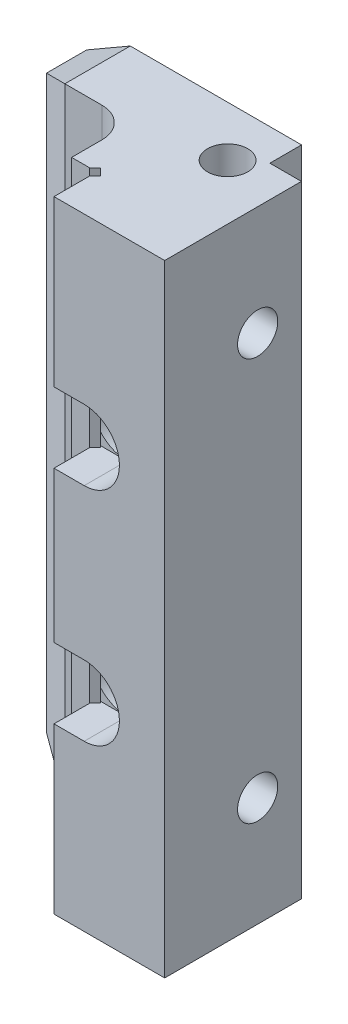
ISO-10303-21;
HEADER;
FILE_DESCRIPTION(('STEP AP214'),'2;1');
FILE_NAME('part.step','',(''),(''),'','','');
FILE_SCHEMA(('AUTOMOTIVE_DESIGN { 1 0 10303 214 1 1 1 1 }'));
ENDSEC;
DATA;
#1=APPLICATION_CONTEXT('core data for automotive mechanical design processes');
#2=APPLICATION_PROTOCOL_DEFINITION('international standard','automotive_design',2000,#1);
#3=PRODUCT_CONTEXT('',#1,'mechanical');
#4=PRODUCT('Part','Part','',(#3));
#5=PRODUCT_RELATED_PRODUCT_CATEGORY('part','',(#4));
#6=PRODUCT_DEFINITION_FORMATION('','',#4);
#7=PRODUCT_DEFINITION_CONTEXT('part definition',#1,'design');
#8=PRODUCT_DEFINITION('design','',#6,#7);
#9=PRODUCT_DEFINITION_SHAPE('','',#8);
#10=(LENGTH_UNIT() NAMED_UNIT(*) SI_UNIT(.MILLI.,.METRE.));
#11=(NAMED_UNIT(*) PLANE_ANGLE_UNIT() SI_UNIT($,.RADIAN.));
#12=(NAMED_UNIT(*) SI_UNIT($,.STERADIAN.) SOLID_ANGLE_UNIT());
#13=UNCERTAINTY_MEASURE_WITH_UNIT(LENGTH_MEASURE(1.E-05),#10,'distance_accuracy_value','');
#14=(GEOMETRIC_REPRESENTATION_CONTEXT(3) GLOBAL_UNCERTAINTY_ASSIGNED_CONTEXT((#13)) GLOBAL_UNIT_ASSIGNED_CONTEXT((#10,
#11,#12)) REPRESENTATION_CONTEXT('',''));
#15=CARTESIAN_POINT('',(0.,0.,0.));
#16=DIRECTION('',(0.,0.,1.));
#17=DIRECTION('',(1.,0.,0.));
#18=AXIS2_PLACEMENT_3D('',#15,#16,#17);
#19=CARTESIAN_POINT('',(29.,22.,13.));
#20=DIRECTION('',(0.,0.,1.));
#21=DIRECTION('',(-1.,0.,0.));
#22=AXIS2_PLACEMENT_3D('',#19,#20,#21);
#23=PLANE('',#22);
#24=DIRECTION('',(0.,-1.,0.));
#25=VECTOR('',#24,1.);
#26=CARTESIAN_POINT('',(-5.33974596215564,22.,13.0000000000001));
#27=LINE('',#26,#25);
#28=CARTESIAN_POINT('',(-5.33974596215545,83.75,13.0000000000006));
#29=VERTEX_POINT('',#28);
#30=CARTESIAN_POINT('',(-5.33974596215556,48.5262692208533,13.0000000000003));
#31=VERTEX_POINT('',#30);
#32=EDGE_CURVE('E725',#29,#31,#27,.T.);
#33=ORIENTED_EDGE('',*,*,#32,.T.);
#34=CARTESIAN_POINT('',(0.,44.,13.0000000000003));
#35=DIRECTION('',(0.,0.,1.));
#36=DIRECTION('',(-1.,0.,0.));
#37=AXIS2_PLACEMENT_3D('',#34,#35,#36);
#38=CIRCLE('',#37,7.);
#39=CARTESIAN_POINT('',(2.00000000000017,50.7082039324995,13.0000000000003));
#40=VERTEX_POINT('',#39);
#41=EDGE_CURVE('E516',#40,#31,#38,.T.);
#42=ORIENTED_EDGE('',*,*,#41,.F.);
#43=DIRECTION('',(0.,1.,0.));
#44=VECTOR('',#43,1.);
#45=CARTESIAN_POINT('',(2.,22.,13.));
#46=LINE('',#45,#44);
#47=CARTESIAN_POINT('',(2.0000000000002,83.75,13.0000000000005));
#48=VERTEX_POINT('',#47);
#49=EDGE_CURVE('E380',#40,#48,#46,.T.);
#50=ORIENTED_EDGE('',*,*,#49,.T.);
#51=DIRECTION('',(-1.,0.,0.));
#52=VECTOR('',#51,1.);
#53=CARTESIAN_POINT('',(28.9999999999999,83.75,13.0000000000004));
#54=LINE('',#53,#52);
#55=EDGE_CURVE('E1002',#29,#48,#54,.F.);
#56=ORIENTED_EDGE('',*,*,#55,.F.);
#57=EDGE_LOOP('',(#33,#42,#50,#56));
#58=FACE_BOUND('',#57,.T.);
#59=ADVANCED_FACE('F17',(#58),#23,.T.);
#60=CARTESIAN_POINT('',(0.,44.,25.));
#61=DIRECTION('',(0.,0.,1.));
#62=DIRECTION('',(-1.,0.,0.));
#63=AXIS2_PLACEMENT_3D('',#60,#61,#62);
#64=CYLINDRICAL_SURFACE('',#63,7.);
#65=CARTESIAN_POINT('',(0.,44.,4.00000000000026));
#66=DIRECTION('',(0.,0.,1.));
#67=DIRECTION('',(-1.,0.,0.));
#68=AXIS2_PLACEMENT_3D('',#65,#66,#67);
#69=CIRCLE('',#68,7.);
#70=CARTESIAN_POINT('',(-6.99999999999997,44.,4.00000000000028));
#71=VERTEX_POINT('',#70);
#72=EDGE_CURVE('E448',#71,#71,#69,.T.);
#73=ORIENTED_EDGE('',*,*,#72,.F.);
#74=EDGE_LOOP('',(#73));
#75=FACE_BOUND('',#74,.T.);
#76=ORIENTED_EDGE('',*,*,#41,.T.);
#77=CARTESIAN_POINT('',(0.,44.,16.082903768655));
#78=DIRECTION('',(0.5,0.,-0.86602540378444));
#79=DIRECTION('',(0.86602540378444,0.,0.5));
#80=AXIS2_PLACEMENT_3D('',#77,#78,#79);
#81=ELLIPSE('',#80,8.08290376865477,7.);
#82=CARTESIAN_POINT('',(-5.33974596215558,39.473730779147,13.0000000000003));
#83=VERTEX_POINT('',#82);
#84=EDGE_CURVE('E696',#31,#83,#81,.F.);
#85=ORIENTED_EDGE('',*,*,#84,.T.);
#86=CARTESIAN_POINT('',(0.,44.,13.0000000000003));
#87=DIRECTION('',(0.,0.,1.));
#88=DIRECTION('',(-1.,0.,0.));
#89=AXIS2_PLACEMENT_3D('',#86,#87,#88);
#90=CIRCLE('',#89,7.);
#91=CARTESIAN_POINT('',(2.00000000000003,37.2917960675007,13.0000000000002));
#92=VERTEX_POINT('',#91);
#93=EDGE_CURVE('E692',#83,#92,#90,.T.);
#94=ORIENTED_EDGE('',*,*,#93,.T.);
#95=CARTESIAN_POINT('',(2.00000000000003,37.2917960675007,13.0000000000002));
#96=CARTESIAN_POINT('',(2.15357726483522,37.3375426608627,12.9999688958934));
#97=CARTESIAN_POINT('',(2.30547969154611,37.388612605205,13.0058942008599));
#98=CARTESIAN_POINT('',(2.60452746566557,37.5006349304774,13.0286602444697));
#99=CARTESIAN_POINT('',(2.75167910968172,37.5615735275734,13.0454858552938));
#100=CARTESIAN_POINT('',(3.0387940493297,37.69203787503,13.088840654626));
#101=CARTESIAN_POINT('',(3.17881489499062,37.7614707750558,13.1152702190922));
#102=CARTESIAN_POINT('',(3.45245586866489,37.9086367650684,13.1767660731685));
#103=CARTESIAN_POINT('',(3.58607390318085,37.986372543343,13.211835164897));
#104=CARTESIAN_POINT('',(3.97488712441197,38.2299624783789,13.327908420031));
#105=CARTESIAN_POINT('',(4.21985791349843,38.4070366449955,13.420078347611));
#106=CARTESIAN_POINT('',(4.68042275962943,38.7862521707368,13.6260524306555));
#107=CARTESIAN_POINT('',(4.89591231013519,38.9884780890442,13.7399302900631));
#108=CARTESIAN_POINT('',(5.24347335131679,39.3575685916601,13.9493104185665));
#109=CARTESIAN_POINT('',(5.38255154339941,39.5196815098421,14.0417312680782));
#110=CARTESIAN_POINT('',(5.64439318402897,39.8543988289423,14.2308822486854));
#111=CARTESIAN_POINT('',(5.76714812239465,40.0270086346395,14.3276145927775));
#112=CARTESIAN_POINT('',(5.99639370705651,40.3822678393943,14.5221166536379));
#113=CARTESIAN_POINT('',(6.10287672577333,40.5649218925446,14.6198868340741));
#114=CARTESIAN_POINT('',(6.29939702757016,40.9401873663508,14.8126283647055));
#115=CARTESIAN_POINT('',(6.38944331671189,41.1327932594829,14.9076012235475));
#116=CARTESIAN_POINT('',(6.52161419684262,41.4532187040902,15.0552851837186));
#117=CARTESIAN_POINT('',(6.56894003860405,41.5778196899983,15.1103324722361));
#118=CARTESIAN_POINT('',(6.65688744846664,41.8311578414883,15.2160694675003));
#119=CARTESIAN_POINT('',(6.69750737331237,41.9598960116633,15.2667581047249));
#120=CARTESIAN_POINT('',(6.80860840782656,42.3518910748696,15.4094909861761));
#121=CARTESIAN_POINT('',(6.86871096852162,42.6218366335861,15.4926461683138));
#122=CARTESIAN_POINT('',(6.93036551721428,43.0087928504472,15.5805789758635));
#123=CARTESIAN_POINT('',(6.94537707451,43.1199605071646,15.6023939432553));
#124=CARTESIAN_POINT('',(6.9701088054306,43.3440535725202,15.6386756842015));
#125=CARTESIAN_POINT('',(6.97983163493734,43.4569780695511,15.6531461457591));
#126=CARTESIAN_POINT('',(6.99377573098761,43.6837797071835,15.6739866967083));
#127=CARTESIAN_POINT('',(6.99800359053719,43.7976555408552,15.680366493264));
#128=CARTESIAN_POINT('',(7.00088123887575,44.0256426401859,15.6847030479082));
#129=CARTESIAN_POINT('',(6.99953096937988,44.1397539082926,15.6826597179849));
#130=CARTESIAN_POINT('',(6.99129008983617,44.36712490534,15.6702736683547));
#131=CARTESIAN_POINT('',(6.98440886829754,44.4803857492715,15.6599450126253));
#132=CARTESIAN_POINT('',(6.96527521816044,44.7054953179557,15.6315688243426));
#133=CARTESIAN_POINT('',(6.95302043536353,44.8173434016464,15.6135179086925));
#134=CARTESIAN_POINT('',(6.90847715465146,45.1502439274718,15.5489700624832));
#135=CARTESIAN_POINT('',(6.8684232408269,45.3683087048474,15.4921011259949));
#136=CARTESIAN_POINT('',(6.77836883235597,45.7568220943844,15.3706986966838));
#137=CARTESIAN_POINT('',(6.7312927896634,45.9289760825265,15.3091988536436));
#138=CARTESIAN_POINT('',(6.62536702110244,46.2662162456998,15.1772855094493));
#139=CARTESIAN_POINT('',(6.56650909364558,46.4312973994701,15.106865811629));
#140=CARTESIAN_POINT('',(6.4374818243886,46.7548592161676,14.9604078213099));
#141=CARTESIAN_POINT('',(6.36728632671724,46.9133235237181,14.8843567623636));
#142=CARTESIAN_POINT('',(6.21600923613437,47.2235056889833,14.7295215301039));
#143=CARTESIAN_POINT('',(6.13493008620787,47.3752250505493,14.6507379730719));
#144=CARTESIAN_POINT('',(5.95578699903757,47.6827287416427,14.4869616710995));
#145=CARTESIAN_POINT('',(5.85692240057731,47.8380256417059,14.4019284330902));
#146=CARTESIAN_POINT('',(5.64678587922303,48.140990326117,14.2335447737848));
#147=CARTESIAN_POINT('',(5.53551224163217,48.2886570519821,14.1501945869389));
#148=CARTESIAN_POINT('',(5.30064140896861,48.5757534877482,13.9874018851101));
#149=CARTESIAN_POINT('',(5.17706294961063,48.7151952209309,13.9079536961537));
#150=CARTESIAN_POINT('',(4.91745000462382,48.985361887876,13.7548846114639));
#151=CARTESIAN_POINT('',(4.7814150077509,49.116086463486,13.6812639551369));
#152=CARTESIAN_POINT('',(4.41004155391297,49.44470660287,13.4994028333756));
#153=CARTESIAN_POINT('',(4.16464841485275,49.6350699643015,13.3973571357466));
#154=CARTESIAN_POINT('',(3.77425807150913,49.8974202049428,13.2666897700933));
#155=CARTESIAN_POINT('',(3.64053921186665,49.9809408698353,13.2268928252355));
#156=CARTESIAN_POINT('',(3.36606050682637,50.1396020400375,13.1558631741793));
#157=CARTESIAN_POINT('',(3.22530447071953,50.2147470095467,13.1246258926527));
#158=CARTESIAN_POINT('',(2.96028129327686,50.3446784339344,13.0760627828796));
#159=CARTESIAN_POINT('',(2.83692831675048,50.4008049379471,13.057317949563));
#160=CARTESIAN_POINT('',(2.58640477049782,50.50607145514,13.0273925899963));
#161=CARTESIAN_POINT('',(2.45923529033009,50.5552134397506,13.0162099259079));
#162=CARTESIAN_POINT('',(2.20084462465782,50.6464400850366,13.0019581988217));
#163=CARTESIAN_POINT('',(2.06960007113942,50.6884685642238,12.9989511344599));
#164=CARTESIAN_POINT('',(1.80483361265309,50.7647378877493,13.0017058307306));
#165=CARTESIAN_POINT('',(1.67130973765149,50.7989715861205,13.0074756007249));
#166=CARTESIAN_POINT('',(1.53719123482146,50.8291319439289,13.0178759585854));
#167=B_SPLINE_CURVE_WITH_KNOTS('',3,(#95,#96,#97,#98,#99,#100,#101,#102,#103,#104,#105,#106,
#107,#108,#109,#110,#111,#112,#113,#114,#115,#116,#117,#118,#119,#120,#121,#122,#123,#124,#125,
#126,#127,#128,#129,#130,#131,#132,#133,#134,#135,#136,#137,#138,#139,#140,#141,#142,#143,#144,
#145,#146,#147,#148,#149,#150,#151,#152,#153,#154,#155,#156,#157,#158,#159,#160,#161,#162,#163,
#164,#165,#166),.UNSPECIFIED.,.F.,.F.,(4,2,2,2,2,2,2,2,2,2,2,2,2,2,2,2,2,2,2,2,2,2,2,2,2,2,2,2,
2,2,2,2,2,2,2,4),(0.,0.480405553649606,0.960145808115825,1.43504538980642,1.91009920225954,
2.85421315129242,3.80159161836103,4.49895876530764,5.19668807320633,5.89474345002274,
6.59241519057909,7.02475734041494,7.45720527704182,8.31888218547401,8.66142698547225,
9.00379960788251,9.34576106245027,9.68772609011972,10.0291118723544,10.3706473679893,
11.0547413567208,11.6203457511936,12.1863452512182,12.7536696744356,13.3208669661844,
13.9286975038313,14.5366121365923,15.1436148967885,15.7506425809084,16.7270602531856,
17.2144082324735,17.7014952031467,18.1115254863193,18.5214398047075,18.9344540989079,
19.3478455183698),.UNSPECIFIED.);
#168=EDGE_CURVE('E684',#92,#40,#167,.T.);
#169=ORIENTED_EDGE('',*,*,#168,.T.);
#170=EDGE_LOOP('',(#76,#85,#94,#169));
#171=FACE_BOUND('',#170,.T.);
#172=ADVANCED_FACE('F675',(#75,#171),#64,.F.);
#173=CARTESIAN_POINT('',(0.,39.5,4.00000000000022));
#174=DIRECTION('',(0.,0.,-1.));
#175=DIRECTION('',(1.,0.,0.));
#176=AXIS2_PLACEMENT_3D('',#173,#174,#175);
#177=PLANE('',#176);
#178=ORIENTED_EDGE('',*,*,#72,.T.);
#179=EDGE_LOOP('',(#178));
#180=FACE_BOUND('',#179,.T.);
#181=CARTESIAN_POINT('',(0.,44.,4.00000000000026));
#182=DIRECTION('',(0.,0.,1.));
#183=DIRECTION('',(-1.,0.,0.));
#184=AXIS2_PLACEMENT_3D('',#181,#182,#183);
#185=CIRCLE('',#184,4.5);
#186=CARTESIAN_POINT('',(-4.49999999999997,44.,4.00000000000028));
#187=VERTEX_POINT('',#186);
#188=EDGE_CURVE('E482',#187,#187,#185,.F.);
#189=ORIENTED_EDGE('',*,*,#188,.T.);
#190=EDGE_LOOP('',(#189));
#191=FACE_BOUND('',#190,.T.);
#192=ADVANCED_FACE('F679',(#180,#191),#177,.F.);
#193=CARTESIAN_POINT('',(0.,44.,25.));
#194=DIRECTION('',(0.,0.,1.));
#195=DIRECTION('',(-1.,0.,0.));
#196=AXIS2_PLACEMENT_3D('',#193,#194,#195);
#197=CYLINDRICAL_SURFACE('',#196,4.5);
#198=ORIENTED_EDGE('',*,*,#188,.F.);
#199=EDGE_LOOP('',(#198));
#200=FACE_BOUND('',#199,.T.);
#201=CARTESIAN_POINT('',(0.,44.,-3.99999999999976));
#202=DIRECTION('',(0.,0.,1.));
#203=DIRECTION('',(0.,1.,0.));
#204=AXIS2_PLACEMENT_3D('',#201,#202,#203);
#205=CIRCLE('',#204,4.5);
#206=CARTESIAN_POINT('',(0.,48.5,-3.99999999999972));
#207=VERTEX_POINT('',#206);
#208=EDGE_CURVE('E693',#207,#207,#205,.F.);
#209=ORIENTED_EDGE('',*,*,#208,.T.);
#210=EDGE_LOOP('',(#209));
#211=FACE_BOUND('',#210,.T.);
#212=ADVANCED_FACE('F1288',(#200,#211),#197,.F.);
#213=CARTESIAN_POINT('',(-1.11022302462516E-13,1.2490009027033E-13,13.));
#214=DIRECTION('',(0.,0.,1.));
#215=DIRECTION('',(-1.,0.,0.));
#216=AXIS2_PLACEMENT_3D('',#213,#214,#215);
#217=CIRCLE('',#216,7.);
#218=CARTESIAN_POINT('',(-5.33974596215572,-4.52626922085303,13.));
#219=VERTEX_POINT('',#218);
#220=CARTESIAN_POINT('',(1.99999999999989,-6.70820393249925,13.));
#221=VERTEX_POINT('',#220);
#222=EDGE_CURVE('E743',#219,#221,#217,.T.);
#223=ORIENTED_EDGE('',*,*,#222,.F.);
#224=CARTESIAN_POINT('',(-5.33974596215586,-39.75,12.9999999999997));
#225=VERTEX_POINT('',#224);
#226=EDGE_CURVE('E661',#219,#225,#27,.T.);
#227=ORIENTED_EDGE('',*,*,#226,.T.);
#228=DIRECTION('',(-1.,0.,0.));
#229=VECTOR('',#228,1.);
#230=CARTESIAN_POINT('',(35.,-39.75,12.9999999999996));
#231=LINE('',#230,#229);
#232=CARTESIAN_POINT('',(1.99999999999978,-39.75,12.9999999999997));
#233=VERTEX_POINT('',#232);
#234=EDGE_CURVE('E1031',#225,#233,#231,.F.);
#235=ORIENTED_EDGE('',*,*,#234,.T.);
#236=EDGE_CURVE('E353',#233,#221,#46,.T.);
#237=ORIENTED_EDGE('',*,*,#236,.T.);
#238=EDGE_LOOP('',(#223,#227,#235,#237));
#239=FACE_BOUND('',#238,.T.);
#240=ADVANCED_FACE('F1284',(#239),#23,.T.);
#241=CARTESIAN_POINT('',(1.99999999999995,6.70820393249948,13.));
#242=VERTEX_POINT('',#241);
#243=EDGE_CURVE('E658',#242,#92,#46,.T.);
#244=ORIENTED_EDGE('',*,*,#243,.T.);
#245=ORIENTED_EDGE('',*,*,#93,.F.);
#246=CARTESIAN_POINT('',(-5.3397459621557,4.52626922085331,13.));
#247=VERTEX_POINT('',#246);
#248=EDGE_CURVE('E728',#83,#247,#27,.T.);
#249=ORIENTED_EDGE('',*,*,#248,.T.);
#250=EDGE_CURVE('E1298',#242,#247,#217,.T.);
#251=ORIENTED_EDGE('',*,*,#250,.F.);
#252=EDGE_LOOP('',(#244,#245,#249,#251));
#253=FACE_BOUND('',#252,.T.);
#254=ADVANCED_FACE('F606',(#253),#23,.T.);
#255=CARTESIAN_POINT('',(35.,83.75,33.5000000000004));
#256=DIRECTION('',(-0.999999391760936,0.,0.00110294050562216));
#257=DIRECTION('',(-0.00110294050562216,0.,-0.999999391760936));
#258=AXIS2_PLACEMENT_3D('',#255,#256,#257);
#259=PLANE('',#258);
#260=CARTESIAN_POINT('',(34.9795955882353,62.,15.0000000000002));
#261=DIRECTION('',(0.999999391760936,0.,-0.00110294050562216));
#262=DIRECTION('',(0.00110294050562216,0.,0.999999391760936));
#263=AXIS2_PLACEMENT_3D('',#260,#261,#262);
#264=CIRCLE('',#263,4.);
#265=CARTESIAN_POINT('',(34.9840073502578,62.,18.999997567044));
#266=VERTEX_POINT('',#265);
#267=EDGE_CURVE('E901',#266,#266,#264,.T.);
#268=ORIENTED_EDGE('',*,*,#267,.F.);
#269=EDGE_LOOP('',(#268));
#270=FACE_BOUND('',#269,.T.);
#271=CARTESIAN_POINT('',(34.9795955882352,-18.,14.9999999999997));
#272=DIRECTION('',(0.999999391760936,0.,-0.00110294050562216));
#273=DIRECTION('',(0.00110294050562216,0.,0.999999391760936));
#274=AXIS2_PLACEMENT_3D('',#271,#272,#273);
#275=CIRCLE('',#274,4.);
#276=CARTESIAN_POINT('',(34.9840073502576,-18.,18.9999975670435));
#277=VERTEX_POINT('',#276);
#278=EDGE_CURVE('E911',#277,#277,#275,.T.);
#279=ORIENTED_EDGE('',*,*,#278,.F.);
#280=EDGE_LOOP('',(#279));
#281=FACE_BOUND('',#280,.T.);
#282=DIRECTION('',(-0.00110294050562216,0.,-0.999999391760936));
#283=VECTOR('',#282,1.);
#284=CARTESIAN_POINT('',(34.9630515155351,-39.75,4.07520044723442E-05));
#285=LINE('',#284,#283);
#286=CARTESIAN_POINT('',(35.,-39.7500000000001,33.4999999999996));
#287=VERTEX_POINT('',#286);
#288=CARTESIAN_POINT('',(34.97,-39.75,6.29999999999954));
#289=VERTEX_POINT('',#288);
#290=EDGE_CURVE('E1073',#287,#289,#285,.T.);
#291=ORIENTED_EDGE('',*,*,#290,.T.);
#292=DIRECTION('',(0.,1.,0.));
#293=VECTOR('',#292,1.);
#294=CARTESIAN_POINT('',(34.97,83.75,6.3000000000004));
#295=LINE('',#294,#293);
#296=CARTESIAN_POINT('',(34.97,83.75,6.3000000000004));
#297=VERTEX_POINT('',#296);
#298=EDGE_CURVE('E922',#297,#289,#295,.F.);
#299=ORIENTED_EDGE('',*,*,#298,.F.);
#300=DIRECTION('',(-0.00110294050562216,0.,-0.999999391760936));
#301=VECTOR('',#300,1.);
#302=CARTESIAN_POINT('',(35.,83.75,33.5000000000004));
#303=LINE('',#302,#301);
#304=CARTESIAN_POINT('',(35.,83.75,33.5000000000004));
#305=VERTEX_POINT('',#304);
#306=EDGE_CURVE('E1114',#305,#297,#303,.T.);
#307=ORIENTED_EDGE('',*,*,#306,.F.);
#308=DIRECTION('',(0.,-1.,0.));
#309=VECTOR('',#308,1.);
#310=CARTESIAN_POINT('',(35.,83.75,33.5000000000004));
#311=LINE('',#310,#309);
#312=EDGE_CURVE('E405',#287,#305,#311,.F.);
#313=ORIENTED_EDGE('',*,*,#312,.F.);
#314=EDGE_LOOP('',(#291,#299,#307,#313));
#315=FACE_BOUND('',#314,.T.);
#316=ADVANCED_FACE('F602',(#270,#281,#315),#259,.F.);
#317=CARTESIAN_POINT('',(-5.33974596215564,22.,13.0000000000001));
#318=DIRECTION('',(0.5,0.,-0.86602540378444));
#319=DIRECTION('',(0.86602540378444,0.,0.5));
#320=AXIS2_PLACEMENT_3D('',#317,#318,#319);
#321=PLANE('',#320);
#322=ORIENTED_EDGE('',*,*,#84,.F.);
#323=ORIENTED_EDGE('',*,*,#32,.F.);
#324=DIRECTION('',(-0.774596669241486,-0.447213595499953,-0.447213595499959));
#325=VECTOR('',#324,1.);
#326=CARTESIAN_POINT('',(-5.77275866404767,83.5,12.7500000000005));
#327=LINE('',#326,#325);
#328=CARTESIAN_POINT('',(-13.9999999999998,78.75,8.00000000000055));
#329=VERTEX_POINT('',#328);
#330=EDGE_CURVE('E936',#29,#329,#327,.T.);
#331=ORIENTED_EDGE('',*,*,#330,.T.);
#332=DIRECTION('',(0.,-1.,0.));
#333=VECTOR('',#332,1.);
#334=CARTESIAN_POINT('',(-14.,22.,8.00000000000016));
#335=LINE('',#334,#333);
#336=CARTESIAN_POINT('',(-14.0000000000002,-34.75,7.99999999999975));
#337=VERTEX_POINT('',#336);
#338=EDGE_CURVE('E937',#337,#329,#335,.F.);
#339=ORIENTED_EDGE('',*,*,#338,.F.);
#340=DIRECTION('',(0.774596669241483,-0.447213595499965,0.447213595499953));
#341=VECTOR('',#340,1.);
#342=CARTESIAN_POINT('',(-14.0000000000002,-34.75,7.99999999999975));
#343=LINE('',#342,#341);
#344=EDGE_CURVE('E356',#337,#225,#343,.T.);
#345=ORIENTED_EDGE('',*,*,#344,.T.);
#346=ORIENTED_EDGE('',*,*,#226,.F.);
#347=CARTESIAN_POINT('',(0.,0.,16.0829037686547));
#348=DIRECTION('',(0.5,0.,-0.86602540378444));
#349=DIRECTION('',(0.86602540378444,0.,0.5));
#350=AXIS2_PLACEMENT_3D('',#347,#348,#349);
#351=ELLIPSE('',#350,8.08290376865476,7.);
#352=EDGE_CURVE('E656',#219,#247,#351,.T.);
#353=ORIENTED_EDGE('',*,*,#352,.T.);
#354=ORIENTED_EDGE('',*,*,#248,.F.);
#355=EDGE_LOOP('',(#322,#323,#331,#339,#345,#346,#353,#354));
#356=FACE_BOUND('',#355,.T.);
#357=ADVANCED_FACE('F605',(#356),#321,.F.);
#358=CARTESIAN_POINT('',(2.,22.,19.));
#359=DIRECTION('',(0.,1.,0.));
#360=DIRECTION('',(-1.,0.,0.));
#361=AXIS2_PLACEMENT_3D('',#358,#359,#360);
#362=CYLINDRICAL_SURFACE('',#361,6.);
#363=ORIENTED_EDGE('',*,*,#168,.F.);
#364=ORIENTED_EDGE('',*,*,#243,.F.);
#365=CARTESIAN_POINT('',(1.99999999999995,6.70820393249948,13.));
#366=CARTESIAN_POINT('',(2.15357726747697,6.66245733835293,12.9999688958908));
#367=CARTESIAN_POINT('',(2.30547969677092,6.61138739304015,13.0058942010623));
#368=CARTESIAN_POINT('',(2.60452747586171,6.49936506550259,13.0286602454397));
#369=CARTESIAN_POINT('',(2.75167912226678,6.43842646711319,13.045485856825));
#370=CARTESIAN_POINT('',(3.03879406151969,6.30796211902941,13.0888406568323));
#371=CARTESIAN_POINT('',(3.17881490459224,6.23852921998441,13.1152702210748));
#372=CARTESIAN_POINT('',(3.45245587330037,6.09136323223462,13.1767660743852));
#373=CARTESIAN_POINT('',(3.58607390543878,6.01362745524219,13.2118351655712));
#374=CARTESIAN_POINT('',(3.97488712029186,5.77003752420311,13.3279084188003));
#375=CARTESIAN_POINT('',(4.2198579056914,5.59296336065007,13.4200783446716));
#376=CARTESIAN_POINT('',(4.68042275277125,5.21374783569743,13.626052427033));
#377=CARTESIAN_POINT('',(4.89591230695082,5.01152191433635,13.7399302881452));
#378=CARTESIAN_POINT('',(5.24347335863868,4.64243140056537,13.9493104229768));
#379=CARTESIAN_POINT('',(5.38255155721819,4.48031847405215,14.0417312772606));
#380=CARTESIAN_POINT('',(5.64439320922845,4.14560113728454,14.230882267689));
#381=CARTESIAN_POINT('',(5.76714815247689,3.97299132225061,14.3276146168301));
#382=CARTESIAN_POINT('',(5.99639373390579,3.61773211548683,14.5221166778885));
#383=CARTESIAN_POINT('',(6.1028767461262,3.43507807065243,14.6198868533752));
#384=CARTESIAN_POINT('',(6.29939703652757,3.05981261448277,14.8126283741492));
#385=CARTESIAN_POINT('',(6.38944332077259,2.86720673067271,14.9076012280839));
#386=CARTESIAN_POINT('',(6.52161418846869,2.54678131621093,15.055285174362));
#387=CARTESIAN_POINT('',(6.56894002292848,2.42218035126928,15.110332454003));
#388=CARTESIAN_POINT('',(6.65688742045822,2.16884224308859,15.2160694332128));
#389=CARTESIAN_POINT('',(6.69750734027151,2.04010409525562,15.2667580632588));
#390=CARTESIAN_POINT('',(6.80860838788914,1.64810901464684,15.4094909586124));
#391=CARTESIAN_POINT('',(6.86871096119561,1.37816341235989,15.4926461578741));
#392=CARTESIAN_POINT('',(6.93036552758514,0.991207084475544,15.580578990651));
#393=CARTESIAN_POINT('',(6.94537709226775,0.88003936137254,15.6023939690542));
#394=CARTESIAN_POINT('',(6.97010883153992,0.655946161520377,15.6386757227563));
#395=CARTESIAN_POINT('',(6.97983166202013,0.543021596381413,15.6531461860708));
#396=CARTESIAN_POINT('',(6.99377574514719,0.316219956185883,15.67398671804));
#397=CARTESIAN_POINT('',(6.99800359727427,0.202344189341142,15.6803665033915));
#398=CARTESIAN_POINT('',(7.00088123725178,-0.0256427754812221,15.684703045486));
#399=CARTESIAN_POINT('',(6.99953096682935,-0.139753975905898,15.6826597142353));
#400=CARTESIAN_POINT('',(6.99129009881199,-0.367124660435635,15.6702736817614));
#401=CARTESIAN_POINT('',(6.98440889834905,-0.480385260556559,15.6599450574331));
#402=CARTESIAN_POINT('',(6.96527531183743,-0.705494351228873,15.6315689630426));
#403=CARTESIAN_POINT('',(6.95302057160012,-0.817342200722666,15.6135181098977));
#404=CARTESIAN_POINT('',(6.90847732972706,-1.15024298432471,15.548970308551));
#405=CARTESIAN_POINT('',(6.86842336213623,-1.36830822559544,15.4921012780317));
#406=CARTESIAN_POINT('',(6.77836848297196,-1.75682356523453,15.3706982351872));
#407=CARTESIAN_POINT('',(6.73129196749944,-1.92897898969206,15.3091978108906));
#408=CARTESIAN_POINT('',(6.62536520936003,-2.26622172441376,15.1772832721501));
#409=CARTESIAN_POINT('',(6.56650676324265,-2.43130401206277,15.1068629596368));
#410=CARTESIAN_POINT('',(6.43747876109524,-2.75486612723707,14.9604045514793));
#411=CARTESIAN_POINT('',(6.36728323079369,-2.9133297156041,14.8843537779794));
#412=CARTESIAN_POINT('',(6.21600844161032,-3.22350747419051,14.729520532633));
#413=CARTESIAN_POINT('',(6.13493163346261,-3.37522315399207,14.6507386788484));
#414=CARTESIAN_POINT('',(5.95578656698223,-3.68272866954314,14.486962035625));
#415=CARTESIAN_POINT('',(5.85691723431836,-3.83803200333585,14.4019264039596));
#416=CARTESIAN_POINT('',(5.64680451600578,-4.14096454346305,14.2335575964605));
#417=CARTESIAN_POINT('',(5.5355593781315,-4.28859265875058,14.1502246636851));
#418=CARTESIAN_POINT('',(5.18341960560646,-4.7190541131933,13.906158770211));
#419=CARTESIAN_POINT('',(4.92370467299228,-4.99018250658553,13.7509583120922));
#420=CARTESIAN_POINT('',(4.40991772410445,-5.44481214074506,13.4993298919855));
#421=CARTESIAN_POINT('',(4.1646285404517,-5.63508958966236,13.3973429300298));
#422=CARTESIAN_POINT('',(3.77427257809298,-5.89740732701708,13.2666983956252));
#423=CARTESIAN_POINT('',(3.64055213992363,-5.98092961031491,13.226899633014));
#424=CARTESIAN_POINT('',(3.36608824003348,-6.13958979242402,13.1558668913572));
#425=CARTESIAN_POINT('',(3.22534737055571,-6.21473075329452,13.1246297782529));
#426=CARTESIAN_POINT('',(2.90921778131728,-6.36970734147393,13.0667106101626));
#427=CARTESIAN_POINT('',(2.73245125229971,-6.44756871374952,13.0421266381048));
#428=CARTESIAN_POINT('',(2.46176047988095,-6.55356306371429,13.0171043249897));
#429=CARTESIAN_POINT('',(2.37045430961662,-6.58714048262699,13.0107385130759));
#430=CARTESIAN_POINT('',(2.1863038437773,-6.65053133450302,13.0021842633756));
#431=CARTESIAN_POINT('',(2.09345882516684,-6.6803429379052,12.9999978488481));
#432=CARTESIAN_POINT('',(1.99999999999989,-6.70820393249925,13.));
#433=B_SPLINE_CURVE_WITH_KNOTS('',3,(#365,#366,#367,#368,#369,#370,#371,#372,#373,#374,#375,
#376,#377,#378,#379,#380,#381,#382,#383,#384,#385,#386,#387,#388,#389,#390,#391,#392,#393,#394,
#395,#396,#397,#398,#399,#400,#401,#402,#403,#404,#405,#406,#407,#408,#409,#410,#411,#412,#413,
#414,#415,#416,#417,#418,#419,#420,#421,#422,#423,#424,#425,#426,#427,#428,#429,#430,#431,#432),
.UNSPECIFIED.,.F.,.F.,(4,2,2,2,2,2,2,2,2,2,2,2,2,2,2,2,2,2,2,2,2,2,2,2,2,2,2,2,2,2,2,2,2,4),(0.,
0.480405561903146,0.96014582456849,1.43504539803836,1.9100992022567,2.85421313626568,
3.80159161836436,4.4989587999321,5.19668814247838,5.89474348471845,6.59241519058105,
7.02475726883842,7.45720513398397,8.31888218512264,8.66142718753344,9.003800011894,
9.34576126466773,9.68772608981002,10.0291111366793,10.3706458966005,11.0547413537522,
11.6203504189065,12.1863546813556,12.7536746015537,13.320866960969,13.9286841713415,
14.5365875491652,15.7496560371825,16.7260805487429,17.2133839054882,17.700508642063,
18.2832630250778,18.5755887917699,18.8680560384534),.UNSPECIFIED.);
#434=EDGE_CURVE('E646',#242,#221,#433,.T.);
#435=ORIENTED_EDGE('',*,*,#434,.T.);
#436=ORIENTED_EDGE('',*,*,#236,.F.);
#437=CARTESIAN_POINT('',(1.99999999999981,-39.75,18.9999999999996));
#438=DIRECTION('',(0.,-1.,0.));
#439=DIRECTION('',(1.,0.,0.));
#440=AXIS2_PLACEMENT_3D('',#437,#438,#439);
#441=CIRCLE('',#440,6.);
#442=CARTESIAN_POINT('',(7.9999999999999,-39.75,18.9999999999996));
#443=VERTEX_POINT('',#442);
#444=EDGE_CURVE('E1043',#233,#443,#441,.T.);
#445=ORIENTED_EDGE('',*,*,#444,.T.);
#446=DIRECTION('',(0.,-1.,0.));
#447=VECTOR('',#446,1.);
#448=CARTESIAN_POINT('',(8.00000000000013,83.75,19.0000000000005));
#449=LINE('',#448,#447);
#450=CARTESIAN_POINT('',(8.00000000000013,83.75,19.0000000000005));
#451=VERTEX_POINT('',#450);
#452=EDGE_CURVE('E349',#443,#451,#449,.F.);
#453=ORIENTED_EDGE('',*,*,#452,.T.);
#454=CARTESIAN_POINT('',(2.00000000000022,83.75,19.0000000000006));
#455=DIRECTION('',(0.,1.,0.));
#456=DIRECTION('',(-1.,0.,0.));
#457=AXIS2_PLACEMENT_3D('',#454,#455,#456);
#458=CIRCLE('',#457,6.);
#459=EDGE_CURVE('E1008',#48,#451,#458,.F.);
#460=ORIENTED_EDGE('',*,*,#459,.F.);
#461=ORIENTED_EDGE('',*,*,#49,.F.);
#462=EDGE_LOOP('',(#363,#364,#435,#436,#445,#453,#460,#461));
#463=FACE_BOUND('',#462,.T.);
#464=ADVANCED_FACE('F638',(#463),#362,.F.);
#465=CARTESIAN_POINT('',(29.,22.,-4.00000000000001));
#466=DIRECTION('',(0.,0.,1.));
#467=DIRECTION('',(0.,1.,0.));
#468=AXIS2_PLACEMENT_3D('',#465,#466,#467);
#469=PLANE('',#468);
#470=ORIENTED_EDGE('',*,*,#208,.F.);
#471=EDGE_LOOP('',(#470));
#472=FACE_BOUND('',#471,.T.);
#473=DIRECTION('',(-1.,0.,0.));
#474=VECTOR('',#473,1.);
#475=CARTESIAN_POINT('',(29.,-6.79999999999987,-4.00000000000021));
#476=LINE('',#475,#474);
#477=CARTESIAN_POINT('',(6.99999999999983,-6.79999999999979,-4.00000000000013));
#478=VERTEX_POINT('',#477);
#479=CARTESIAN_POINT('',(-7.00000000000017,-6.79999999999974,-4.00000000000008));
#480=VERTEX_POINT('',#479);
#481=EDGE_CURVE('E1165',#478,#480,#476,.T.);
#482=ORIENTED_EDGE('',*,*,#481,.T.);
#483=DIRECTION('',(0.,1.,0.));
#484=VECTOR('',#483,1.);
#485=CARTESIAN_POINT('',(-7.00000000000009,22.0000000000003,-3.99999999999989));
#486=LINE('',#485,#484);
#487=CARTESIAN_POINT('',(-7.00000000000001,50.8,-3.99999999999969));
#488=VERTEX_POINT('',#487);
#489=EDGE_CURVE('E1169',#480,#488,#486,.T.);
#490=ORIENTED_EDGE('',*,*,#489,.T.);
#491=DIRECTION('',(1.,0.,0.));
#492=VECTOR('',#491,1.);
#493=CARTESIAN_POINT('',(29.,50.8,-3.99999999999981));
#494=LINE('',#493,#492);
#495=CARTESIAN_POINT('',(6.99999999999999,50.8,-3.99999999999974));
#496=VERTEX_POINT('',#495);
#497=EDGE_CURVE('E1158',#488,#496,#494,.T.);
#498=ORIENTED_EDGE('',*,*,#497,.T.);
#499=DIRECTION('',(0.,-1.,0.));
#500=VECTOR('',#499,1.);
#501=CARTESIAN_POINT('',(6.99999999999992,22.,-3.99999999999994));
#502=LINE('',#501,#500);
#503=EDGE_CURVE('E1162',#496,#478,#502,.T.);
#504=ORIENTED_EDGE('',*,*,#503,.T.);
#505=EDGE_LOOP('',(#482,#490,#498,#504));
#506=FACE_BOUND('',#505,.T.);
#507=CARTESIAN_POINT('',(-1.66533453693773E-13,2.35922392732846E-13,-4.00000000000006));
#508=DIRECTION('',(0.,0.,1.));
#509=DIRECTION('',(0.,1.,0.));
#510=AXIS2_PLACEMENT_3D('',#507,#508,#509);
#511=CIRCLE('',#510,4.5);
#512=CARTESIAN_POINT('',(-1.50821787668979E-13,4.50000000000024,-4.00000000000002));
#513=VERTEX_POINT('',#512);
#514=EDGE_CURVE('E657',#513,#513,#511,.T.);
#515=ORIENTED_EDGE('',*,*,#514,.T.);
#516=EDGE_LOOP('',(#515));
#517=FACE_BOUND('',#516,.T.);
#518=ADVANCED_FACE('F642',(#472,#506,#517),#469,.F.);
#519=CARTESIAN_POINT('',(11.93933982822,-39.75,27.4748737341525));
#520=DIRECTION('',(0.707106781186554,0.,0.707106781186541));
#521=DIRECTION('',(-0.707106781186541,0.,0.707106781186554));
#522=AXIS2_PLACEMENT_3D('',#519,#520,#521);
#523=PLANE('',#522);
#524=DIRECTION('',(0.,1.,0.));
#525=VECTOR('',#524,1.);
#526=CARTESIAN_POINT('',(13.0000000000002,83.75,26.4142135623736));
#527=LINE('',#526,#525);
#528=CARTESIAN_POINT('',(13.,7.,26.414213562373));
#529=VERTEX_POINT('',#528);
#530=CARTESIAN_POINT('',(13.,37.,26.4142135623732));
#531=VERTEX_POINT('',#530);
#532=EDGE_CURVE('E424',#529,#531,#527,.T.);
#533=ORIENTED_EDGE('',*,*,#532,.T.);
#534=DIRECTION('',(-0.707106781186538,0.,0.707106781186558));
#535=VECTOR('',#534,1.);
#536=CARTESIAN_POINT('',(14.0606601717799,37.,25.3535533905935));
#537=LINE('',#536,#535);
#538=CARTESIAN_POINT('',(14.0606601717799,37.,25.3535533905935));
#539=VERTEX_POINT('',#538);
#540=EDGE_CURVE('E475',#539,#531,#537,.T.);
#541=ORIENTED_EDGE('',*,*,#540,.F.);
#542=DIRECTION('',(0.,-1.,0.));
#543=VECTOR('',#542,1.);
#544=CARTESIAN_POINT('',(14.0606601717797,-39.75,25.3535533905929));
#545=LINE('',#544,#543);
#546=CARTESIAN_POINT('',(14.0606601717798,7.,25.3535533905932));
#547=VERTEX_POINT('',#546);
#548=EDGE_CURVE('E501',#539,#547,#545,.T.);
#549=ORIENTED_EDGE('',*,*,#548,.T.);
#550=DIRECTION('',(-0.70710678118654,0.,0.707106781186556));
#551=VECTOR('',#550,1.);
#552=CARTESIAN_POINT('',(14.0606601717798,7.,25.3535533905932));
#553=LINE('',#552,#551);
#554=EDGE_CURVE('E449',#547,#529,#553,.T.);
#555=ORIENTED_EDGE('',*,*,#554,.T.);
#556=EDGE_LOOP('',(#533,#541,#549,#555));
#557=FACE_BOUND('',#556,.T.);
#558=ADVANCED_FACE('F672',(#557),#523,.F.);
#559=CARTESIAN_POINT('',(29.,37.,-11.7695526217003));
#560=DIRECTION('',(0.,1.,0.));
#561=DIRECTION('',(0.,0.,-1.));
#562=AXIS2_PLACEMENT_3D('',#559,#560,#561);
#563=PLANE('',#562);
#564=DIRECTION('',(0.707106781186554,0.,0.707106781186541));
#565=VECTOR('',#564,1.);
#566=CARTESIAN_POINT('',(14.0606601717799,37.,25.3535533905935));
#567=LINE('',#566,#565);
#568=CARTESIAN_POINT('',(13.7071067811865,37.,25.));
#569=VERTEX_POINT('',#568);
#570=EDGE_CURVE('E425',#569,#539,#567,.T.);
#571=ORIENTED_EDGE('',*,*,#570,.T.);
#572=ORIENTED_EDGE('',*,*,#540,.T.);
#573=DIRECTION('',(0.,0.,-1.));
#574=VECTOR('',#573,1.);
#575=CARTESIAN_POINT('',(13.,37.,-11.7695526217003));
#576=LINE('',#575,#574);
#577=CARTESIAN_POINT('',(13.,37.,33.5));
#578=VERTEX_POINT('',#577);
#579=EDGE_CURVE('E1182',#578,#531,#576,.T.);
#580=ORIENTED_EDGE('',*,*,#579,.F.);
#581=DIRECTION('',(-1.,0.,0.));
#582=VECTOR('',#581,1.);
#583=CARTESIAN_POINT('',(35.,37.,33.5));
#584=LINE('',#583,#582);
#585=CARTESIAN_POINT('',(19.,37.,33.5));
#586=VERTEX_POINT('',#585);
#587=EDGE_CURVE('E718',#578,#586,#584,.F.);
#588=ORIENTED_EDGE('',*,*,#587,.T.);
#589=DIRECTION('',(0.,0.,1.));
#590=VECTOR('',#589,1.);
#591=CARTESIAN_POINT('',(19.,37.,33.5));
#592=LINE('',#591,#590);
#593=CARTESIAN_POINT('',(18.9999999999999,37.,25.));
#594=VERTEX_POINT('',#593);
#595=EDGE_CURVE('E478',#586,#594,#592,.F.);
#596=ORIENTED_EDGE('',*,*,#595,.T.);
#597=DIRECTION('',(1.,0.,0.));
#598=VECTOR('',#597,1.);
#599=CARTESIAN_POINT('',(-14.,37.,25.));
#600=LINE('',#599,#598);
#601=EDGE_CURVE('E470',#594,#569,#600,.F.);
#602=ORIENTED_EDGE('',*,*,#601,.T.);
#603=EDGE_LOOP('',(#571,#572,#580,#588,#596,#602));
#604=FACE_BOUND('',#603,.T.);
#605=ADVANCED_FACE('F1219',(#604),#563,.T.);
#606=CARTESIAN_POINT('',(-13.9999999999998,83.75,25.0000000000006));
#607=DIRECTION('',(0.,0.,-1.));
#608=DIRECTION('',(1.,0.,0.));
#609=AXIS2_PLACEMENT_3D('',#606,#607,#608);
#610=PLANE('',#609);
#611=ORIENTED_EDGE('',*,*,#601,.F.);
#612=CARTESIAN_POINT('',(18.9999999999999,44.,25.));
#613=DIRECTION('',(0.,0.,1.));
#614=DIRECTION('',(-1.,0.,0.));
#615=AXIS2_PLACEMENT_3D('',#612,#613,#614);
#616=CIRCLE('',#615,7.);
#617=CARTESIAN_POINT('',(13.7071067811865,39.4190305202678,25.));
#618=VERTEX_POINT('',#617);
#619=EDGE_CURVE('E481',#594,#618,#616,.F.);
#620=ORIENTED_EDGE('',*,*,#619,.T.);
#621=DIRECTION('',(0.,-1.,0.));
#622=VECTOR('',#621,1.);
#623=CARTESIAN_POINT('',(13.7071067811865,-39.75,24.9999999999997));
#624=LINE('',#623,#622);
#625=EDGE_CURVE('E433',#618,#569,#624,.T.);
#626=ORIENTED_EDGE('',*,*,#625,.T.);
#627=EDGE_LOOP('',(#611,#620,#626));
#628=FACE_BOUND('',#627,.T.);
#629=ADVANCED_FACE('F1263',(#628),#610,.F.);
#630=CARTESIAN_POINT('',(-13.9999999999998,83.75,25.0000000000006));
#631=DIRECTION('',(0.,0.,-1.));
#632=DIRECTION('',(1.,0.,0.));
#633=AXIS2_PLACEMENT_3D('',#630,#631,#632);
#634=PLANE('',#633);
#635=DIRECTION('',(0.,-1.,0.));
#636=VECTOR('',#635,1.);
#637=CARTESIAN_POINT('',(13.7071067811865,-39.75,24.9999999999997));
#638=LINE('',#637,#636);
#639=CARTESIAN_POINT('',(13.7071067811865,7.00000000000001,25.));
#640=VERTEX_POINT('',#639);
#641=CARTESIAN_POINT('',(13.7071067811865,4.58096947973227,25.));
#642=VERTEX_POINT('',#641);
#643=EDGE_CURVE('E437',#640,#642,#638,.T.);
#644=ORIENTED_EDGE('',*,*,#643,.T.);
#645=CARTESIAN_POINT('',(19.,0.,25.));
#646=DIRECTION('',(0.,0.,1.));
#647=DIRECTION('',(-1.,0.,0.));
#648=AXIS2_PLACEMENT_3D('',#645,#646,#647);
#649=CIRCLE('',#648,7.);
#650=CARTESIAN_POINT('',(19.,7.00000000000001,25.));
#651=VERTEX_POINT('',#650);
#652=EDGE_CURVE('E464',#642,#651,#649,.F.);
#653=ORIENTED_EDGE('',*,*,#652,.T.);
#654=DIRECTION('',(-1.,0.,0.));
#655=VECTOR('',#654,1.);
#656=CARTESIAN_POINT('',(29.,7.00000000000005,25.));
#657=LINE('',#656,#655);
#658=EDGE_CURVE('E467',#651,#640,#657,.T.);
#659=ORIENTED_EDGE('',*,*,#658,.T.);
#660=EDGE_LOOP('',(#644,#653,#659));
#661=FACE_BOUND('',#660,.T.);
#662=ADVANCED_FACE('F1353',(#661),#634,.F.);
#663=CARTESIAN_POINT('',(29.,7.0000000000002,-11.7695526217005));
#664=DIRECTION('',(0.,1.,0.));
#665=DIRECTION('',(-1.,0.,0.));
#666=AXIS2_PLACEMENT_3D('',#663,#664,#665);
#667=PLANE('',#666);
#668=DIRECTION('',(0.,0.,1.));
#669=VECTOR('',#668,1.);
#670=CARTESIAN_POINT('',(19.,6.99999999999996,33.5));
#671=LINE('',#670,#669);
#672=CARTESIAN_POINT('',(19.,6.99999999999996,33.5));
#673=VERTEX_POINT('',#672);
#674=EDGE_CURVE('E394',#651,#673,#671,.T.);
#675=ORIENTED_EDGE('',*,*,#674,.T.);
#676=DIRECTION('',(1.,0.,0.));
#677=VECTOR('',#676,1.);
#678=CARTESIAN_POINT('',(29.,6.99999999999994,33.5));
#679=LINE('',#678,#677);
#680=CARTESIAN_POINT('',(13.,7.00000000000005,33.5));
#681=VERTEX_POINT('',#680);
#682=EDGE_CURVE('E1200',#681,#673,#679,.T.);
#683=ORIENTED_EDGE('',*,*,#682,.F.);
#684=DIRECTION('',(0.,0.,-1.));
#685=VECTOR('',#684,1.);
#686=CARTESIAN_POINT('',(12.9999999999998,7.00000000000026,-11.7695526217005));
#687=LINE('',#686,#685);
#688=EDGE_CURVE('E1173',#529,#681,#687,.F.);
#689=ORIENTED_EDGE('',*,*,#688,.F.);
#690=ORIENTED_EDGE('',*,*,#554,.F.);
#691=DIRECTION('',(0.707106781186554,0.,0.707106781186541));
#692=VECTOR('',#691,1.);
#693=CARTESIAN_POINT('',(14.0606601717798,7.,25.3535533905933));
#694=LINE('',#693,#692);
#695=EDGE_CURVE('E442',#547,#640,#694,.F.);
#696=ORIENTED_EDGE('',*,*,#695,.T.);
#697=ORIENTED_EDGE('',*,*,#658,.F.);
#698=EDGE_LOOP('',(#675,#683,#689,#690,#696,#697));
#699=FACE_BOUND('',#698,.T.);
#700=ADVANCED_FACE('F1228',(#699),#667,.F.);
#701=CARTESIAN_POINT('',(29.,-6.9999999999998,-11.7695526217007));
#702=DIRECTION('',(0.,1.,0.));
#703=DIRECTION('',(0.,0.,-1.));
#704=AXIS2_PLACEMENT_3D('',#701,#702,#703);
#705=PLANE('',#704);
#706=DIRECTION('',(0.707106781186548,0.,0.707106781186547));
#707=VECTOR('',#706,1.);
#708=CARTESIAN_POINT('',(13.7071067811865,-6.99999999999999,25.));
#709=LINE('',#708,#707);
#710=CARTESIAN_POINT('',(13.7071067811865,-6.99999999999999,25.));
#711=VERTEX_POINT('',#710);
#712=CARTESIAN_POINT('',(14.0606601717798,-7.,25.3535533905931));
#713=VERTEX_POINT('',#712);
#714=EDGE_CURVE('E445',#711,#713,#709,.T.);
#715=ORIENTED_EDGE('',*,*,#714,.T.);
#716=DIRECTION('',(-0.707106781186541,0.,0.707106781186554));
#717=VECTOR('',#716,1.);
#718=CARTESIAN_POINT('',(11.9393398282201,-7.,27.4748737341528));
#719=LINE('',#718,#717);
#720=CARTESIAN_POINT('',(13.,-7.,26.414213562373));
#721=VERTEX_POINT('',#720);
#722=EDGE_CURVE('E393',#713,#721,#719,.T.);
#723=ORIENTED_EDGE('',*,*,#722,.T.);
#724=DIRECTION('',(0.,0.,-1.));
#725=VECTOR('',#724,1.);
#726=CARTESIAN_POINT('',(12.9999999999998,-6.99999999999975,-11.7695526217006));
#727=LINE('',#726,#725);
#728=CARTESIAN_POINT('',(13.,-6.99999999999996,33.5));
#729=VERTEX_POINT('',#728);
#730=EDGE_CURVE('E1188',#729,#721,#727,.T.);
#731=ORIENTED_EDGE('',*,*,#730,.F.);
#732=DIRECTION('',(-1.,0.,0.));
#733=VECTOR('',#732,1.);
#734=CARTESIAN_POINT('',(35.,-7.00000000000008,33.5));
#735=LINE('',#734,#733);
#736=CARTESIAN_POINT('',(19.,-7.00000000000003,33.5));
#737=VERTEX_POINT('',#736);
#738=EDGE_CURVE('E1194',#729,#737,#735,.F.);
#739=ORIENTED_EDGE('',*,*,#738,.T.);
#740=DIRECTION('',(0.,0.,1.));
#741=VECTOR('',#740,1.);
#742=CARTESIAN_POINT('',(19.,-7.00000000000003,33.5));
#743=LINE('',#742,#741);
#744=CARTESIAN_POINT('',(19.,-6.99999999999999,25.));
#745=VERTEX_POINT('',#744);
#746=EDGE_CURVE('E452',#737,#745,#743,.F.);
#747=ORIENTED_EDGE('',*,*,#746,.T.);
#748=DIRECTION('',(1.,0.,0.));
#749=VECTOR('',#748,1.);
#750=CARTESIAN_POINT('',(-14.,-6.99999999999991,25.));
#751=LINE('',#750,#749);
#752=EDGE_CURVE('E376',#745,#711,#751,.F.);
#753=ORIENTED_EDGE('',*,*,#752,.T.);
#754=EDGE_LOOP('',(#715,#723,#731,#739,#747,#753));
#755=FACE_BOUND('',#754,.T.);
#756=ADVANCED_FACE('F1236',(#755),#705,.T.);
#757=CARTESIAN_POINT('',(14.0606601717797,-39.75,25.3535533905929));
#758=DIRECTION('',(0.707106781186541,0.,-0.707106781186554));
#759=DIRECTION('',(0.707106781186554,0.,0.707106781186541));
#760=AXIS2_PLACEMENT_3D('',#757,#758,#759);
#761=PLANE('',#760);
#762=ORIENTED_EDGE('',*,*,#625,.F.);
#763=CARTESIAN_POINT('',(19.,44.,30.2928932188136));
#764=DIRECTION('',(0.707106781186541,0.,-0.707106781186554));
#765=DIRECTION('',(0.707106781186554,0.,0.707106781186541));
#766=AXIS2_PLACEMENT_3D('',#763,#764,#765);
#767=ELLIPSE('',#766,9.8994949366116,7.);
#768=CARTESIAN_POINT('',(12.646446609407,41.0619123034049,23.9393398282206));
#769=VERTEX_POINT('',#768);
#770=EDGE_CURVE('E833',#618,#769,#767,.T.);
#771=ORIENTED_EDGE('',*,*,#770,.T.);
#772=DIRECTION('',(0.,-1.,0.));
#773=VECTOR('',#772,1.);
#774=CARTESIAN_POINT('',(12.6464466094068,-39.75,23.93933982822));
#775=LINE('',#774,#773);
#776=CARTESIAN_POINT('',(12.6464466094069,2.93808769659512,23.9393398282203));
#777=VERTEX_POINT('',#776);
#778=EDGE_CURVE('E352',#769,#777,#775,.T.);
#779=ORIENTED_EDGE('',*,*,#778,.T.);
#780=CARTESIAN_POINT('',(19.,0.,30.2928932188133));
#781=DIRECTION('',(0.707106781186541,0.,-0.707106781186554));
#782=DIRECTION('',(0.707106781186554,0.,0.707106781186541));
#783=AXIS2_PLACEMENT_3D('',#780,#781,#782);
#784=ELLIPSE('',#783,9.8994949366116,7.);
#785=EDGE_CURVE('E828',#777,#642,#784,.T.);
#786=ORIENTED_EDGE('',*,*,#785,.T.);
#787=ORIENTED_EDGE('',*,*,#643,.F.);
#788=ORIENTED_EDGE('',*,*,#695,.F.);
#789=ORIENTED_EDGE('',*,*,#548,.F.);
#790=ORIENTED_EDGE('',*,*,#570,.F.);
#791=EDGE_LOOP('',(#762,#771,#779,#786,#787,#788,#789,#790));
#792=FACE_BOUND('',#791,.T.);
#793=ADVANCED_FACE('F1266',(#792),#761,.F.);
#794=CARTESIAN_POINT('',(29.,51.,-11.7695526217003));
#795=DIRECTION('',(0.,1.,0.));
#796=DIRECTION('',(-1.,0.,0.));
#797=AXIS2_PLACEMENT_3D('',#794,#795,#796);
#798=PLANE('',#797);
#799=DIRECTION('',(0.,0.,1.));
#800=VECTOR('',#799,1.);
#801=CARTESIAN_POINT('',(19.,51.,33.5));
#802=LINE('',#801,#800);
#803=CARTESIAN_POINT('',(18.9999999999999,51.,25.));
#804=VERTEX_POINT('',#803);
#805=CARTESIAN_POINT('',(19.,51.,33.5));
#806=VERTEX_POINT('',#805);
#807=EDGE_CURVE('E414',#804,#806,#802,.T.);
#808=ORIENTED_EDGE('',*,*,#807,.T.);
#809=DIRECTION('',(1.,0.,0.));
#810=VECTOR('',#809,1.);
#811=CARTESIAN_POINT('',(29.,51.,33.5));
#812=LINE('',#811,#810);
#813=CARTESIAN_POINT('',(13.0000000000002,51.,33.5));
#814=VERTEX_POINT('',#813);
#815=EDGE_CURVE('E710',#814,#806,#812,.T.);
#816=ORIENTED_EDGE('',*,*,#815,.F.);
#817=DIRECTION('',(0.,0.,-1.));
#818=VECTOR('',#817,1.);
#819=CARTESIAN_POINT('',(13.,51.,-11.7695526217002));
#820=LINE('',#819,#818);
#821=CARTESIAN_POINT('',(13.0000000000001,51.,26.4142135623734));
#822=VERTEX_POINT('',#821);
#823=EDGE_CURVE('E1176',#822,#814,#820,.F.);
#824=ORIENTED_EDGE('',*,*,#823,.F.);
#825=DIRECTION('',(-0.707106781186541,0.,0.707106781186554));
#826=VECTOR('',#825,1.);
#827=CARTESIAN_POINT('',(11.9393398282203,51.,27.4748737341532));
#828=LINE('',#827,#826);
#829=CARTESIAN_POINT('',(14.06066017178,51.,25.3535533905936));
#830=VERTEX_POINT('',#829);
#831=EDGE_CURVE('E312',#822,#830,#828,.F.);
#832=ORIENTED_EDGE('',*,*,#831,.T.);
#833=DIRECTION('',(0.707106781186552,0.,0.707106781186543));
#834=VECTOR('',#833,1.);
#835=CARTESIAN_POINT('',(13.7071067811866,51.,25.));
#836=LINE('',#835,#834);
#837=CARTESIAN_POINT('',(13.7071067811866,51.,25.));
#838=VERTEX_POINT('',#837);
#839=EDGE_CURVE('E321',#838,#830,#836,.T.);
#840=ORIENTED_EDGE('',*,*,#839,.F.);
#841=DIRECTION('',(1.,0.,0.));
#842=VECTOR('',#841,1.);
#843=CARTESIAN_POINT('',(-13.9999999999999,51.,25.0000000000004));
#844=LINE('',#843,#842);
#845=EDGE_CURVE('E430',#838,#804,#844,.T.);
#846=ORIENTED_EDGE('',*,*,#845,.T.);
#847=EDGE_LOOP('',(#808,#816,#824,#832,#840,#846));
#848=FACE_BOUND('',#847,.T.);
#849=ADVANCED_FACE('F1254',(#848),#798,.F.);
#850=CARTESIAN_POINT('',(13.0000000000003,83.75,33.5000000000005));
#851=DIRECTION('',(1.,0.,0.));
#852=DIRECTION('',(0.,1.,0.));
#853=AXIS2_PLACEMENT_3D('',#850,#851,#852);
#854=PLANE('',#853);
#855=DIRECTION('',(0.,1.,0.));
#856=VECTOR('',#855,1.);
#857=CARTESIAN_POINT('',(12.9999999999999,-39.75,33.4999999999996));
#858=LINE('',#857,#856);
#859=EDGE_CURVE('E401',#578,#681,#858,.F.);
#860=ORIENTED_EDGE('',*,*,#859,.F.);
#861=ORIENTED_EDGE('',*,*,#579,.T.);
#862=ORIENTED_EDGE('',*,*,#532,.F.);
#863=ORIENTED_EDGE('',*,*,#688,.T.);
#864=EDGE_LOOP('',(#860,#861,#862,#863));
#865=FACE_BOUND('',#864,.T.);
#866=ADVANCED_FACE('F1271',(#865),#854,.F.);
#867=CARTESIAN_POINT('',(13.0000000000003,83.75,33.5000000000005));
#868=DIRECTION('',(1.,0.,0.));
#869=DIRECTION('',(0.,1.,0.));
#870=AXIS2_PLACEMENT_3D('',#867,#868,#869);
#871=PLANE('',#870);
#872=DIRECTION('',(0.,1.,0.));
#873=VECTOR('',#872,1.);
#874=CARTESIAN_POINT('',(12.9999999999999,-39.75,33.4999999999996));
#875=LINE('',#874,#873);
#876=CARTESIAN_POINT('',(12.9999999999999,-39.75,33.4999999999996));
#877=VERTEX_POINT('',#876);
#878=EDGE_CURVE('E395',#729,#877,#875,.F.);
#879=ORIENTED_EDGE('',*,*,#878,.F.);
#880=ORIENTED_EDGE('',*,*,#730,.T.);
#881=DIRECTION('',(0.,-1.,0.));
#882=VECTOR('',#881,1.);
#883=CARTESIAN_POINT('',(12.9999999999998,-39.75,26.4142135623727));
#884=LINE('',#883,#882);
#885=CARTESIAN_POINT('',(12.9999999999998,-39.75,26.4142135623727));
#886=VERTEX_POINT('',#885);
#887=EDGE_CURVE('E455',#721,#886,#884,.T.);
#888=ORIENTED_EDGE('',*,*,#887,.T.);
#889=DIRECTION('',(0.,0.,1.));
#890=VECTOR('',#889,1.);
#891=CARTESIAN_POINT('',(12.9999999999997,-39.75,-3.7470027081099E-13));
#892=LINE('',#891,#890);
#893=EDGE_CURVE('E1055',#886,#877,#892,.T.);
#894=ORIENTED_EDGE('',*,*,#893,.T.);
#895=EDGE_LOOP('',(#879,#880,#888,#894));
#896=FACE_BOUND('',#895,.T.);
#897=ADVANCED_FACE('F1241',(#896),#871,.F.);
#898=CARTESIAN_POINT('',(11.93933982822,-39.75,27.4748737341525));
#899=DIRECTION('',(0.707106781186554,0.,0.707106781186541));
#900=DIRECTION('',(-0.707106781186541,0.,0.707106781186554));
#901=AXIS2_PLACEMENT_3D('',#898,#899,#900);
#902=PLANE('',#901);
#903=ORIENTED_EDGE('',*,*,#887,.F.);
#904=ORIENTED_EDGE('',*,*,#722,.F.);
#905=DIRECTION('',(0.,-1.,0.));
#906=VECTOR('',#905,1.);
#907=CARTESIAN_POINT('',(14.0606601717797,-39.75,25.3535533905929));
#908=LINE('',#907,#906);
#909=CARTESIAN_POINT('',(14.0606601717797,-39.75,25.3535533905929));
#910=VERTEX_POINT('',#909);
#911=EDGE_CURVE('E523',#713,#910,#908,.T.);
#912=ORIENTED_EDGE('',*,*,#911,.T.);
#913=DIRECTION('',(-0.707106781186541,0.,0.707106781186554));
#914=VECTOR('',#913,1.);
#915=CARTESIAN_POINT('',(11.93933982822,-39.75,27.4748737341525));
#916=LINE('',#915,#914);
#917=EDGE_CURVE('E390',#886,#910,#916,.F.);
#918=ORIENTED_EDGE('',*,*,#917,.F.);
#919=EDGE_LOOP('',(#903,#904,#912,#918));
#920=FACE_BOUND('',#919,.T.);
#921=ADVANCED_FACE('F1279',(#920),#902,.F.);
#922=CARTESIAN_POINT('',(19.,0.,33.5));
#923=DIRECTION('',(0.,0.,1.));
#924=DIRECTION('',(-1.,0.,0.));
#925=AXIS2_PLACEMENT_3D('',#922,#923,#924);
#926=CYLINDRICAL_SURFACE('',#925,7.);
#927=CARTESIAN_POINT('',(19.,0.,16.));
#928=DIRECTION('',(0.,0.,1.));
#929=DIRECTION('',(-1.,0.,0.));
#930=AXIS2_PLACEMENT_3D('',#927,#928,#929);
#931=CIRCLE('',#930,7.);
#932=CARTESIAN_POINT('',(12.,0.,16.));
#933=VERTEX_POINT('',#932);
#934=EDGE_CURVE('E528',#933,#933,#931,.F.);
#935=ORIENTED_EDGE('',*,*,#934,.T.);
#936=EDGE_LOOP('',(#935));
#937=FACE_BOUND('',#936,.T.);
#938=ORIENTED_EDGE('',*,*,#785,.F.);
#939=CARTESIAN_POINT('',(19.,0.,17.5857864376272));
#940=DIRECTION('',(-0.707106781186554,0.,-0.707106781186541));
#941=DIRECTION('',(-0.707106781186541,0.,0.707106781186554));
#942=AXIS2_PLACEMENT_3D('',#939,#940,#941);
#943=ELLIPSE('',#942,9.89949493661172,7.);
#944=CARTESIAN_POINT('',(12.6464466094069,-2.93808769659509,23.9393398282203));
#945=VERTEX_POINT('',#944);
#946=EDGE_CURVE('E368',#777,#945,#943,.F.);
#947=ORIENTED_EDGE('',*,*,#946,.T.);
#948=CARTESIAN_POINT('',(19.,0.,30.2928932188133));
#949=DIRECTION('',(0.707106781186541,0.,-0.707106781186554));
#950=DIRECTION('',(0.707106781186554,0.,0.707106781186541));
#951=AXIS2_PLACEMENT_3D('',#948,#949,#950);
#952=ELLIPSE('',#951,9.8994949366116,7.);
#953=CARTESIAN_POINT('',(13.7071067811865,-4.58096947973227,25.));
#954=VERTEX_POINT('',#953);
#955=EDGE_CURVE('E973',#945,#954,#952,.F.);
#956=ORIENTED_EDGE('',*,*,#955,.T.);
#957=CARTESIAN_POINT('',(19.,0.,25.));
#958=DIRECTION('',(0.,0.,1.));
#959=DIRECTION('',(-1.,0.,0.));
#960=AXIS2_PLACEMENT_3D('',#957,#958,#959);
#961=CIRCLE('',#960,7.);
#962=EDGE_CURVE('E381',#954,#745,#961,.T.);
#963=ORIENTED_EDGE('',*,*,#962,.T.);
#964=ORIENTED_EDGE('',*,*,#746,.F.);
#965=CARTESIAN_POINT('',(19.,0.,33.5));
#966=DIRECTION('',(0.,0.,1.));
#967=DIRECTION('',(0.,1.,0.));
#968=AXIS2_PLACEMENT_3D('',#965,#966,#967);
#969=CIRCLE('',#968,7.);
#970=EDGE_CURVE('E1203',#737,#673,#969,.T.);
#971=ORIENTED_EDGE('',*,*,#970,.T.);
#972=ORIENTED_EDGE('',*,*,#674,.F.);
#973=ORIENTED_EDGE('',*,*,#652,.F.);
#974=EDGE_LOOP('',(#938,#947,#956,#963,#964,#971,#972,#973));
#975=FACE_BOUND('',#974,.T.);
#976=ADVANCED_FACE('F1234',(#937,#975),#926,.F.);
#977=CARTESIAN_POINT('',(-13.9999999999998,83.75,25.0000000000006));
#978=DIRECTION('',(0.,0.,-1.));
#979=DIRECTION('',(1.,0.,0.));
#980=AXIS2_PLACEMENT_3D('',#977,#978,#979);
#981=PLANE('',#980);
#982=ORIENTED_EDGE('',*,*,#752,.F.);
#983=ORIENTED_EDGE('',*,*,#962,.F.);
#984=DIRECTION('',(0.,-1.,0.));
#985=VECTOR('',#984,1.);
#986=CARTESIAN_POINT('',(13.7071067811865,-39.75,24.9999999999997));
#987=LINE('',#986,#985);
#988=EDGE_CURVE('E969',#954,#711,#987,.T.);
#989=ORIENTED_EDGE('',*,*,#988,.T.);
#990=EDGE_LOOP('',(#982,#983,#989));
#991=FACE_BOUND('',#990,.T.);
#992=ADVANCED_FACE('F636',(#991),#981,.F.);
#993=CARTESIAN_POINT('',(8.00000000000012,83.75,13.0000000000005));
#994=DIRECTION('',(1.,0.,0.));
#995=DIRECTION('',(0.,0.,1.));
#996=AXIS2_PLACEMENT_3D('',#993,#994,#995);
#997=PLANE('',#996);
#998=ORIENTED_EDGE('',*,*,#452,.F.);
#999=DIRECTION('',(0.,0.,-1.));
#1000=VECTOR('',#999,1.);
#1001=CARTESIAN_POINT('',(7.99999999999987,-39.75,12.9999999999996));
#1002=LINE('',#1001,#1000);
#1003=CARTESIAN_POINT('',(7.99999999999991,-39.75,24.9999999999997));
#1004=VERTEX_POINT('',#1003);
#1005=EDGE_CURVE('E1037',#1004,#443,#1002,.T.);
#1006=ORIENTED_EDGE('',*,*,#1005,.F.);
#1007=DIRECTION('',(0.,1.,0.));
#1008=VECTOR('',#1007,1.);
#1009=CARTESIAN_POINT('',(8.00000000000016,83.75,25.0000000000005));
#1010=LINE('',#1009,#1008);
#1011=CARTESIAN_POINT('',(8.00000000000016,83.75,25.0000000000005));
#1012=VERTEX_POINT('',#1011);
#1013=EDGE_CURVE('E998',#1012,#1004,#1010,.F.);
#1014=ORIENTED_EDGE('',*,*,#1013,.F.);
#1015=DIRECTION('',(0.,0.,1.));
#1016=VECTOR('',#1015,1.);
#1017=CARTESIAN_POINT('',(8.00000000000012,83.75,13.0000000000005));
#1018=LINE('',#1017,#1016);
#1019=EDGE_CURVE('E1014',#451,#1012,#1018,.T.);
#1020=ORIENTED_EDGE('',*,*,#1019,.F.);
#1021=EDGE_LOOP('',(#998,#1006,#1014,#1020));
#1022=FACE_BOUND('',#1021,.T.);
#1023=ADVANCED_FACE('F632',(#1022),#997,.F.);
#1024=CARTESIAN_POINT('',(-13.9999999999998,83.75,25.0000000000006));
#1025=DIRECTION('',(0.,0.,-1.));
#1026=DIRECTION('',(1.,0.,0.));
#1027=AXIS2_PLACEMENT_3D('',#1024,#1025,#1026);
#1028=PLANE('',#1027);
#1029=DIRECTION('',(0.,-1.,0.));
#1030=VECTOR('',#1029,1.);
#1031=CARTESIAN_POINT('',(11.5857864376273,-39.75,24.9999999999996));
#1032=LINE('',#1031,#1030);
#1033=CARTESIAN_POINT('',(11.5857864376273,-39.75,24.9999999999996));
#1034=VERTEX_POINT('',#1033);
#1035=CARTESIAN_POINT('',(11.5857864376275,83.75,25.0000000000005));
#1036=VERTEX_POINT('',#1035);
#1037=EDGE_CURVE('E367',#1034,#1036,#1032,.F.);
#1038=ORIENTED_EDGE('',*,*,#1037,.T.);
#1039=DIRECTION('',(1.,0.,0.));
#1040=VECTOR('',#1039,1.);
#1041=CARTESIAN_POINT('',(-13.9999999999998,83.75,25.0000000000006));
#1042=LINE('',#1041,#1040);
#1043=EDGE_CURVE('E1020',#1012,#1036,#1042,.T.);
#1044=ORIENTED_EDGE('',*,*,#1043,.F.);
#1045=ORIENTED_EDGE('',*,*,#1013,.T.);
#1046=DIRECTION('',(-1.,0.,0.));
#1047=VECTOR('',#1046,1.);
#1048=CARTESIAN_POINT('',(-14.0000000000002,-39.75,24.9999999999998));
#1049=LINE('',#1048,#1047);
#1050=EDGE_CURVE('E1025',#1034,#1004,#1049,.T.);
#1051=ORIENTED_EDGE('',*,*,#1050,.F.);
#1052=EDGE_LOOP('',(#1038,#1044,#1045,#1051));
#1053=FACE_BOUND('',#1052,.T.);
#1054=ADVANCED_FACE('F628',(#1053),#1028,.F.);
#1055=CARTESIAN_POINT('',(12.6464466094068,-39.75,23.93933982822));
#1056=DIRECTION('',(-0.707106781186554,0.,-0.707106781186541));
#1057=DIRECTION('',(0.707106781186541,0.,-0.707106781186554));
#1058=AXIS2_PLACEMENT_3D('',#1055,#1056,#1057);
#1059=PLANE('',#1058);
#1060=DIRECTION('',(0.707106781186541,0.,-0.707106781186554));
#1061=VECTOR('',#1060,1.);
#1062=CARTESIAN_POINT('',(12.6464466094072,83.75,23.9393398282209));
#1063=LINE('',#1062,#1061);
#1064=CARTESIAN_POINT('',(12.6464466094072,83.75,23.9393398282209));
#1065=VERTEX_POINT('',#1064);
#1066=EDGE_CURVE('E313',#1036,#1065,#1063,.T.);
#1067=ORIENTED_EDGE('',*,*,#1066,.F.);
#1068=ORIENTED_EDGE('',*,*,#1037,.F.);
#1069=DIRECTION('',(0.707106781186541,0.,-0.707106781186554));
#1070=VECTOR('',#1069,1.);
#1071=CARTESIAN_POINT('',(12.6464466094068,-39.75,23.93933982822));
#1072=LINE('',#1071,#1070);
#1073=CARTESIAN_POINT('',(12.6464466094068,-39.75,23.93933982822));
#1074=VERTEX_POINT('',#1073);
#1075=EDGE_CURVE('E364',#1074,#1034,#1072,.F.);
#1076=ORIENTED_EDGE('',*,*,#1075,.F.);
#1077=DIRECTION('',(0.,-1.,0.));
#1078=VECTOR('',#1077,1.);
#1079=CARTESIAN_POINT('',(12.6464466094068,-39.75,23.93933982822));
#1080=LINE('',#1079,#1078);
#1081=EDGE_CURVE('E527',#1074,#945,#1080,.F.);
#1082=ORIENTED_EDGE('',*,*,#1081,.T.);
#1083=ORIENTED_EDGE('',*,*,#946,.F.);
#1084=ORIENTED_EDGE('',*,*,#778,.F.);
#1085=CARTESIAN_POINT('',(19.,44.,17.5857864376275));
#1086=DIRECTION('',(-0.707106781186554,0.,-0.707106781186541));
#1087=DIRECTION('',(-0.707106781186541,0.,0.707106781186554));
#1088=AXIS2_PLACEMENT_3D('',#1085,#1086,#1087);
#1089=ELLIPSE('',#1088,9.89949493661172,7.);
#1090=CARTESIAN_POINT('',(12.6464466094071,46.9380876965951,23.9393398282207));
#1091=VERTEX_POINT('',#1090);
#1092=EDGE_CURVE('E790',#769,#1091,#1089,.T.);
#1093=ORIENTED_EDGE('',*,*,#1092,.T.);
#1094=DIRECTION('',(0.,-1.,0.));
#1095=VECTOR('',#1094,1.);
#1096=CARTESIAN_POINT('',(12.6464466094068,-39.75,23.93933982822));
#1097=LINE('',#1096,#1095);
#1098=EDGE_CURVE('E325',#1091,#1065,#1097,.F.);
#1099=ORIENTED_EDGE('',*,*,#1098,.T.);
#1100=EDGE_LOOP('',(#1067,#1068,#1076,#1082,#1083,#1084,#1093,#1099));
#1101=FACE_BOUND('',#1100,.T.);
#1102=ADVANCED_FACE('F625',(#1101),#1059,.F.);
#1103=CARTESIAN_POINT('',(11.93933982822,-39.75,27.4748737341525));
#1104=DIRECTION('',(0.707106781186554,0.,0.707106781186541));
#1105=DIRECTION('',(-0.707106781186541,0.,0.707106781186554));
#1106=AXIS2_PLACEMENT_3D('',#1103,#1104,#1105);
#1107=PLANE('',#1106);
#1108=ORIENTED_EDGE('',*,*,#831,.F.);
#1109=DIRECTION('',(0.,1.,0.));
#1110=VECTOR('',#1109,1.);
#1111=CARTESIAN_POINT('',(13.0000000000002,83.75,26.4142135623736));
#1112=LINE('',#1111,#1110);
#1113=CARTESIAN_POINT('',(13.0000000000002,83.75,26.4142135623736));
#1114=VERTEX_POINT('',#1113);
#1115=EDGE_CURVE('E306',#822,#1114,#1112,.T.);
#1116=ORIENTED_EDGE('',*,*,#1115,.T.);
#1117=DIRECTION('',(-0.707106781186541,0.,0.707106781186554));
#1118=VECTOR('',#1117,1.);
#1119=CARTESIAN_POINT('',(11.9393398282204,83.75,27.4748737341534));
#1120=LINE('',#1119,#1118);
#1121=CARTESIAN_POINT('',(14.0606601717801,83.75,25.3535533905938));
#1122=VERTEX_POINT('',#1121);
#1123=EDGE_CURVE('E301',#1122,#1114,#1120,.T.);
#1124=ORIENTED_EDGE('',*,*,#1123,.F.);
#1125=DIRECTION('',(0.,-1.,0.));
#1126=VECTOR('',#1125,1.);
#1127=CARTESIAN_POINT('',(14.0606601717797,-39.75,25.3535533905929));
#1128=LINE('',#1127,#1126);
#1129=EDGE_CURVE('E305',#1122,#830,#1128,.T.);
#1130=ORIENTED_EDGE('',*,*,#1129,.T.);
#1131=EDGE_LOOP('',(#1108,#1116,#1124,#1130));
#1132=FACE_BOUND('',#1131,.T.);
#1133=ADVANCED_FACE('F304',(#1132),#1107,.F.);
#1134=CARTESIAN_POINT('',(-13.9999999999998,83.75,25.0000000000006));
#1135=DIRECTION('',(0.,0.,-1.));
#1136=DIRECTION('',(1.,0.,0.));
#1137=AXIS2_PLACEMENT_3D('',#1134,#1135,#1136);
#1138=PLANE('',#1137);
#1139=DIRECTION('',(0.,-1.,0.));
#1140=VECTOR('',#1139,1.);
#1141=CARTESIAN_POINT('',(13.7071067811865,-39.75,24.9999999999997));
#1142=LINE('',#1141,#1140);
#1143=CARTESIAN_POINT('',(13.7071067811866,48.5809694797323,25.));
#1144=VERTEX_POINT('',#1143);
#1145=EDGE_CURVE('E324',#838,#1144,#1142,.T.);
#1146=ORIENTED_EDGE('',*,*,#1145,.T.);
#1147=CARTESIAN_POINT('',(18.9999999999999,44.,25.));
#1148=DIRECTION('',(0.,0.,1.));
#1149=DIRECTION('',(-1.,0.,0.));
#1150=AXIS2_PLACEMENT_3D('',#1147,#1148,#1149);
#1151=CIRCLE('',#1150,7.);
#1152=EDGE_CURVE('E419',#1144,#804,#1151,.F.);
#1153=ORIENTED_EDGE('',*,*,#1152,.T.);
#1154=ORIENTED_EDGE('',*,*,#845,.F.);
#1155=EDGE_LOOP('',(#1146,#1153,#1154));
#1156=FACE_BOUND('',#1155,.T.);
#1157=ADVANCED_FACE('F618',(#1156),#1138,.F.);
#1158=CARTESIAN_POINT('',(19.,44.,33.5));
#1159=DIRECTION('',(0.,0.,1.));
#1160=DIRECTION('',(-1.,0.,0.));
#1161=AXIS2_PLACEMENT_3D('',#1158,#1159,#1160);
#1162=CYLINDRICAL_SURFACE('',#1161,7.);
#1163=ORIENTED_EDGE('',*,*,#1092,.F.);
#1164=ORIENTED_EDGE('',*,*,#770,.F.);
#1165=ORIENTED_EDGE('',*,*,#619,.F.);
#1166=ORIENTED_EDGE('',*,*,#595,.F.);
#1167=CARTESIAN_POINT('',(19.,44.,33.5));
#1168=DIRECTION('',(0.,0.,1.));
#1169=DIRECTION('',(0.,1.,0.));
#1170=AXIS2_PLACEMENT_3D('',#1167,#1168,#1169);
#1171=CIRCLE('',#1170,7.);
#1172=EDGE_CURVE('E704',#806,#586,#1171,.F.);
#1173=ORIENTED_EDGE('',*,*,#1172,.F.);
#1174=ORIENTED_EDGE('',*,*,#807,.F.);
#1175=ORIENTED_EDGE('',*,*,#1152,.F.);
#1176=CARTESIAN_POINT('',(19.,44.,30.2928932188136));
#1177=DIRECTION('',(0.707106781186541,0.,-0.707106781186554));
#1178=DIRECTION('',(0.707106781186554,0.,0.707106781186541));
#1179=AXIS2_PLACEMENT_3D('',#1176,#1177,#1178);
#1180=ELLIPSE('',#1179,9.8994949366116,7.);
#1181=EDGE_CURVE('E950',#1144,#1091,#1180,.F.);
#1182=ORIENTED_EDGE('',*,*,#1181,.T.);
#1183=EDGE_LOOP('',(#1163,#1164,#1165,#1166,#1173,#1174,#1175,#1182));
#1184=FACE_BOUND('',#1183,.T.);
#1185=CARTESIAN_POINT('',(19.,44.,16.));
#1186=DIRECTION('',(0.,0.,1.));
#1187=DIRECTION('',(-1.,0.,0.));
#1188=AXIS2_PLACEMENT_3D('',#1185,#1186,#1187);
#1189=CIRCLE('',#1188,7.);
#1190=CARTESIAN_POINT('',(12.,44.,16.));
#1191=VERTEX_POINT('',#1190);
#1192=EDGE_CURVE('E764',#1191,#1191,#1189,.F.);
#1193=ORIENTED_EDGE('',*,*,#1192,.T.);
#1194=EDGE_LOOP('',(#1193));
#1195=FACE_BOUND('',#1194,.T.);
#1196=ADVANCED_FACE('F614',(#1184,#1195),#1162,.F.);
#1197=CARTESIAN_POINT('',(13.0000000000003,83.75,33.5000000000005));
#1198=DIRECTION('',(1.,0.,0.));
#1199=DIRECTION('',(0.,1.,0.));
#1200=AXIS2_PLACEMENT_3D('',#1197,#1198,#1199);
#1201=PLANE('',#1200);
#1202=ORIENTED_EDGE('',*,*,#1115,.F.);
#1203=ORIENTED_EDGE('',*,*,#823,.T.);
#1204=DIRECTION('',(0.,1.,0.));
#1205=VECTOR('',#1204,1.);
#1206=CARTESIAN_POINT('',(12.9999999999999,-39.75,33.4999999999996));
#1207=LINE('',#1206,#1205);
#1208=CARTESIAN_POINT('',(13.0000000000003,83.75,33.5000000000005));
#1209=VERTEX_POINT('',#1208);
#1210=EDGE_CURVE('E398',#1209,#814,#1207,.F.);
#1211=ORIENTED_EDGE('',*,*,#1210,.F.);
#1212=DIRECTION('',(0.,0.,1.));
#1213=VECTOR('',#1212,1.);
#1214=CARTESIAN_POINT('',(13.0000000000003,83.75,33.5000000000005));
#1215=LINE('',#1214,#1213);
#1216=EDGE_CURVE('E1085',#1114,#1209,#1215,.T.);
#1217=ORIENTED_EDGE('',*,*,#1216,.F.);
#1218=EDGE_LOOP('',(#1202,#1203,#1211,#1217));
#1219=FACE_BOUND('',#1218,.T.);
#1220=ADVANCED_FACE('F610',(#1219),#1201,.F.);
#1221=CARTESIAN_POINT('',(35.,-39.7500000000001,33.4999999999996));
#1222=DIRECTION('',(0.,0.,1.));
#1223=DIRECTION('',(0.,1.,0.));
#1224=AXIS2_PLACEMENT_3D('',#1221,#1222,#1223);
#1225=PLANE('',#1224);
#1226=ORIENTED_EDGE('',*,*,#738,.F.);
#1227=ORIENTED_EDGE('',*,*,#878,.T.);
#1228=DIRECTION('',(-1.,0.,0.));
#1229=VECTOR('',#1228,1.);
#1230=CARTESIAN_POINT('',(35.,-39.7500000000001,33.4999999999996));
#1231=LINE('',#1230,#1229);
#1232=EDGE_CURVE('E1069',#877,#287,#1231,.F.);
#1233=ORIENTED_EDGE('',*,*,#1232,.T.);
#1234=ORIENTED_EDGE('',*,*,#312,.T.);
#1235=DIRECTION('',(-1.,0.,0.));
#1236=VECTOR('',#1235,1.);
#1237=CARTESIAN_POINT('',(35.,83.75,33.5000000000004));
#1238=LINE('',#1237,#1236);
#1239=EDGE_CURVE('E1108',#1209,#305,#1238,.F.);
#1240=ORIENTED_EDGE('',*,*,#1239,.F.);
#1241=ORIENTED_EDGE('',*,*,#1210,.T.);
#1242=ORIENTED_EDGE('',*,*,#815,.T.);
#1243=ORIENTED_EDGE('',*,*,#1172,.T.);
#1244=ORIENTED_EDGE('',*,*,#587,.F.);
#1245=ORIENTED_EDGE('',*,*,#859,.T.);
#1246=ORIENTED_EDGE('',*,*,#682,.T.);
#1247=ORIENTED_EDGE('',*,*,#970,.F.);
#1248=EDGE_LOOP('',(#1226,#1227,#1233,#1234,#1240,#1241,#1242,#1243,#1244,#1245,#1246,#1247));
#1249=FACE_BOUND('',#1248,.T.);
#1250=ADVANCED_FACE('F600',(#1249),#1225,.T.);
#1251=CARTESIAN_POINT('',(30.15,58.,6.30000000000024));
#1252=DIRECTION('',(-0.707106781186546,0.,0.70710678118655));
#1253=DIRECTION('',(-0.70710678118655,0.,-0.707106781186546));
#1254=AXIS2_PLACEMENT_3D('',#1251,#1252,#1253);
#1255=PLANE('',#1254);
#1256=DIRECTION('',(0.,-1.,0.));
#1257=VECTOR('',#1256,1.);
#1258=CARTESIAN_POINT('',(30.15,-44.8686652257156,6.29999999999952));
#1259=LINE('',#1258,#1257);
#1260=CARTESIAN_POINT('',(30.15,-14.,6.29999999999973));
#1261=VERTEX_POINT('',#1260);
#1262=CARTESIAN_POINT('',(30.15,58.,6.30000000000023));
#1263=VERTEX_POINT('',#1262);
#1264=EDGE_CURVE('E947',#1261,#1263,#1259,.F.);
#1265=ORIENTED_EDGE('',*,*,#1264,.T.);
#1266=DIRECTION('',(-0.707106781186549,0.,-0.707106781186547));
#1267=VECTOR('',#1266,1.);
#1268=CARTESIAN_POINT('',(31.6171572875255,58.,7.76715728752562));
#1269=LINE('',#1268,#1267);
#1270=CARTESIAN_POINT('',(31.9,58.,8.05000000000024));
#1271=VERTEX_POINT('',#1270);
#1272=EDGE_CURVE('E754',#1263,#1271,#1269,.F.);
#1273=ORIENTED_EDGE('',*,*,#1272,.T.);
#1274=DIRECTION('',(0.,1.,0.));
#1275=VECTOR('',#1274,1.);
#1276=CARTESIAN_POINT('',(31.9,58.,8.05000000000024));
#1277=LINE('',#1276,#1275);
#1278=CARTESIAN_POINT('',(31.9,-14.,8.04999999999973));
#1279=VERTEX_POINT('',#1278);
#1280=EDGE_CURVE('E27',#1279,#1271,#1277,.T.);
#1281=ORIENTED_EDGE('',*,*,#1280,.F.);
#1282=DIRECTION('',(-0.707106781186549,0.,-0.707106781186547));
#1283=VECTOR('',#1282,1.);
#1284=CARTESIAN_POINT('',(31.6171572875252,-14.,7.76715728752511));
#1285=LINE('',#1284,#1283);
#1286=EDGE_CURVE('E752',#1279,#1261,#1285,.T.);
#1287=ORIENTED_EDGE('',*,*,#1286,.T.);
#1288=EDGE_LOOP('',(#1265,#1273,#1281,#1287));
#1289=FACE_BOUND('',#1288,.T.);
#1290=ADVANCED_FACE('F596',(#1289),#1255,.F.);
#1291=CARTESIAN_POINT('',(31.6171572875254,58.,-1.09999999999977));
#1292=DIRECTION('',(1.,0.,0.));
#1293=DIRECTION('',(0.,1.,0.));
#1294=AXIS2_PLACEMENT_3D('',#1291,#1292,#1293);
#1295=CONICAL_SURFACE('',#1294,8.86715728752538,0.78539816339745);
#1296=CARTESIAN_POINT('',(30.15,58.,6.30000000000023));
#1297=CARTESIAN_POINT('',(30.1499867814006,58.113702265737,6.30000000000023));
#1298=CARTESIAN_POINT('',(30.1526202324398,58.227400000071,6.30000000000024));
#1299=CARTESIAN_POINT('',(30.1630822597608,58.45453867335,6.30000000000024));
#1300=CARTESIAN_POINT('',(30.1709100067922,58.5679796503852,6.30000000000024));
#1301=CARTESIAN_POINT('',(30.191642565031,58.7941763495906,6.30000000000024));
#1302=CARTESIAN_POINT('',(30.2045376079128,58.906932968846,6.30000000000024));
#1303=CARTESIAN_POINT('',(30.235218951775,59.1317739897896,6.30000000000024));
#1304=CARTESIAN_POINT('',(30.2530053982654,59.2438583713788,6.30000000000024));
#1305=CARTESIAN_POINT('',(30.3127268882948,59.5752791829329,6.30000000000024));
#1306=CARTESIAN_POINT('',(30.3613735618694,59.7934324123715,6.30000000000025));
#1307=CARTESIAN_POINT('',(30.4746128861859,60.225582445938,6.30000000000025));
#1308=CARTESIAN_POINT('',(30.5392127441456,60.4395773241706,6.30000000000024));
#1309=CARTESIAN_POINT('',(30.6756384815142,60.8440637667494,6.30000000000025));
#1310=CARTESIAN_POINT('',(30.7463067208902,61.0349498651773,6.30000000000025));
#1311=CARTESIAN_POINT('',(30.8972347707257,61.4128351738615,6.30000000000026));
#1312=CARTESIAN_POINT('',(30.9774932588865,61.5998349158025,6.30000000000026));
#1313=CARTESIAN_POINT('',(31.1469641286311,61.9719935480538,6.30000000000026));
#1314=CARTESIAN_POINT('',(31.2362587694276,62.1571147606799,6.30000000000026));
#1315=CARTESIAN_POINT('',(31.4217824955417,62.5238057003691,6.30000000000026));
#1316=CARTESIAN_POINT('',(31.5180108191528,62.7053758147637,6.30000000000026));
#1317=CARTESIAN_POINT('',(31.7257258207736,63.082391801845,6.30000000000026));
#1318=CARTESIAN_POINT('',(31.8377934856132,63.2775165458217,6.30000000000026));
#1319=CARTESIAN_POINT('',(32.0677438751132,63.664320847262,6.30000000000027));
#1320=CARTESIAN_POINT('',(32.185627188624,63.8560000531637,6.30000000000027));
#1321=CARTESIAN_POINT('',(32.4262904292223,64.236369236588,6.30000000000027));
#1322=CARTESIAN_POINT('',(32.5490724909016,64.4250578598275,6.30000000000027));
#1323=CARTESIAN_POINT('',(32.7987175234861,64.7997207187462,6.30000000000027));
#1324=CARTESIAN_POINT('',(32.9255806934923,64.9856948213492,6.30000000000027));
#1325=CARTESIAN_POINT('',(33.3120078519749,65.5410261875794,6.30000000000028));
#1326=CARTESIAN_POINT('',(33.5767572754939,65.9067766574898,6.30000000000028));
#1327=CARTESIAN_POINT('',(34.1162017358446,66.6306787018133,6.30000000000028));
#1328=CARTESIAN_POINT('',(34.3908945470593,66.9888319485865,6.30000000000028));
#1329=CARTESIAN_POINT('',(34.9326206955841,67.6798591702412,6.30000000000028));
#1330=CARTESIAN_POINT('',(35.1992551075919,68.0130467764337,6.30000000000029));
#1331=CARTESIAN_POINT('',(35.7377778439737,68.6751780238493,6.30000000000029));
#1332=CARTESIAN_POINT('',(36.0096665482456,69.0041213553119,6.30000000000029));
#1333=CARTESIAN_POINT('',(36.5558338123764,69.6564459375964,6.30000000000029));
#1334=CARTESIAN_POINT('',(36.8300860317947,69.9798492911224,6.30000000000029));
#1335=CARTESIAN_POINT('',(37.3818818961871,70.6237500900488,6.3000000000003));
#1336=CARTESIAN_POINT('',(37.6594250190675,70.9442479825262,6.3000000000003));
#1337=CARTESIAN_POINT('',(37.9382593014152,71.2636051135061,6.3000000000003));
#1338=B_SPLINE_CURVE_WITH_KNOTS('',3,(#1296,#1297,#1298,#1299,#1300,#1301,#1302,#1303,#1304,
#1305,#1306,#1307,#1308,#1309,#1310,#1311,#1312,#1313,#1314,#1315,#1316,#1317,#1318,#1319,#1320,
#1321,#1322,#1323,#1324,#1325,#1326,#1327,#1328,#1329,#1330,#1331,#1332,#1333,#1334,#1335,#1336,
#1337),.UNSPECIFIED.,.F.,.F.,(4,2,2,2,2,2,2,2,2,2,2,2,2,2,2,2,2,2,2,2,4),(0.,0.341068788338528,
0.682083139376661,1.02244331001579,1.36281360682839,2.0325923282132,2.70267419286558,
3.31301759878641,3.92327694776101,4.53970091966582,5.15605727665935,5.83098707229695,
6.50598534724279,7.1812810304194,7.85660970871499,9.210886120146,10.564861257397,
11.8450167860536,13.1252652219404,14.3973399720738,15.6692155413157),.UNSPECIFIED.);
#1339=CARTESIAN_POINT('',(31.8999999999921,63.3816818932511,6.30000000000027));
#1340=VERTEX_POINT('',#1339);
#1341=EDGE_CURVE('E571',#1263,#1340,#1338,.T.);
#1342=ORIENTED_EDGE('',*,*,#1341,.T.);
#1343=CARTESIAN_POINT('',(31.8999999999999,58.,-1.09999999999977));
#1344=DIRECTION('',(-1.,0.,0.));
#1345=DIRECTION('',(0.,-1.,0.));
#1346=AXIS2_PLACEMENT_3D('',#1343,#1344,#1345);
#1347=CIRCLE('',#1346,9.15);
#1348=EDGE_CURVE('E11',#1271,#1340,#1347,.T.);
#1349=ORIENTED_EDGE('',*,*,#1348,.F.);
#1350=ORIENTED_EDGE('',*,*,#1272,.F.);
#1351=EDGE_LOOP('',(#1342,#1349,#1350));
#1352=FACE_BOUND('',#1351,.T.);
#1353=ADVANCED_FACE('F592',(#1352),#1295,.F.);
#1354=CARTESIAN_POINT('',(32.1828427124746,58.,-1.09999999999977));
#1355=DIRECTION('',(-1.,0.,0.));
#1356=DIRECTION('',(0.,-1.,0.));
#1357=AXIS2_PLACEMENT_3D('',#1354,#1355,#1356);
#1358=CONICAL_SURFACE('',#1357,8.86715728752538,0.78539816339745);
#1359=DIRECTION('',(-0.707106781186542,0.,0.707106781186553));
#1360=VECTOR('',#1359,1.);
#1361=CARTESIAN_POINT('',(32.1828427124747,58.,7.76715728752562));
#1362=LINE('',#1361,#1360);
#1363=CARTESIAN_POINT('',(33.65,58.,6.30000000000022));
#1364=VERTEX_POINT('',#1363);
#1365=EDGE_CURVE('E33',#1364,#1271,#1362,.T.);
#1366=ORIENTED_EDGE('',*,*,#1365,.T.);
#1367=ORIENTED_EDGE('',*,*,#1348,.T.);
#1368=CARTESIAN_POINT('',(25.861740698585,71.2636051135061,6.30000000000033));
#1369=CARTESIAN_POINT('',(26.1370393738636,70.9482999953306,6.30000000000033));
#1370=CARTESIAN_POINT('',(26.4110775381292,70.631881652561,6.30000000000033));
#1371=CARTESIAN_POINT('',(26.9559534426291,69.9962223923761,6.30000000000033));
#1372=CARTESIAN_POINT('',(27.226790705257,69.6769810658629,6.30000000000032));
#1373=CARTESIAN_POINT('',(27.7662114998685,69.0331340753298,6.30000000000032));
#1374=CARTESIAN_POINT('',(28.0347697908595,68.7085072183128,6.30000000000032));
#1375=CARTESIAN_POINT('',(28.5668112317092,68.0551478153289,6.30000000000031));
#1376=CARTESIAN_POINT('',(28.8302947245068,67.726415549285,6.30000000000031));
#1377=CARTESIAN_POINT('',(29.3727065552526,67.0359631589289,6.3000000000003));
#1378=CARTESIAN_POINT('',(29.651067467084,66.673795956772,6.3000000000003));
#1379=CARTESIAN_POINT('',(30.1977200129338,65.9417527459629,6.30000000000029));
#1380=CARTESIAN_POINT('',(30.4660094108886,65.5718750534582,6.30000000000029));
#1381=CARTESIAN_POINT('',(30.8575779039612,65.0102276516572,6.30000000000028));
#1382=CARTESIAN_POINT('',(30.9861251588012,64.8221294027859,6.30000000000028));
#1383=CARTESIAN_POINT('',(31.2390656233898,64.4431652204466,6.30000000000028));
#1384=CARTESIAN_POINT('',(31.3634590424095,64.252299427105,6.30000000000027));
#1385=CARTESIAN_POINT('',(31.6072516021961,63.8675071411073,6.30000000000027));
#1386=CARTESIAN_POINT('',(31.7266527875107,63.6735819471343,6.30000000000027));
#1387=CARTESIAN_POINT('',(31.959511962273,63.2822077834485,6.30000000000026));
#1388=CARTESIAN_POINT('',(32.0729706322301,63.0847592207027,6.30000000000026));
#1389=CARTESIAN_POINT('',(32.2563948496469,62.7518302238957,6.30000000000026));
#1390=CARTESIAN_POINT('',(32.3283396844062,62.6174411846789,6.30000000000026));
#1391=CARTESIAN_POINT('',(32.4685664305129,62.3467686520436,6.30000000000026));
#1392=CARTESIAN_POINT('',(32.5368483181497,62.2104851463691,6.30000000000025));
#1393=CARTESIAN_POINT('',(32.735518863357,61.7984961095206,6.30000000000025));
#1394=CARTESIAN_POINT('',(32.859690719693,61.5197266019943,6.30000000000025));
#1395=CARTESIAN_POINT('',(33.0846508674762,60.9583378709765,6.30000000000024));
#1396=CARTESIAN_POINT('',(33.1858021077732,60.6758655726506,6.30000000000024));
#1397=CARTESIAN_POINT('',(33.3618197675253,60.1028859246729,6.30000000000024));
#1398=CARTESIAN_POINT('',(33.4367112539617,59.812386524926,6.30000000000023));
#1399=CARTESIAN_POINT('',(33.5207406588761,59.3944987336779,6.30000000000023));
#1400=CARTESIAN_POINT('',(33.5428911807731,59.2696581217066,6.30000000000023));
#1401=CARTESIAN_POINT('',(33.5811858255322,59.0190684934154,6.30000000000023));
#1402=CARTESIAN_POINT('',(33.5973310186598,58.8933196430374,6.30000000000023));
#1403=CARTESIAN_POINT('',(33.6234690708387,58.6398441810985,6.30000000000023));
#1404=CARTESIAN_POINT('',(33.6333953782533,58.512110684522,6.30000000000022));
#1405=CARTESIAN_POINT('',(33.646672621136,58.256254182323,6.30000000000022));
#1406=CARTESIAN_POINT('',(33.6500210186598,58.1281310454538,6.30000000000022));
#1407=CARTESIAN_POINT('',(33.65,58.,6.30000000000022));
#1408=B_SPLINE_CURVE_WITH_KNOTS('',3,(#1368,#1369,#1370,#1371,#1372,#1373,#1374,#1375,#1376,
#1377,#1378,#1379,#1380,#1381,#1382,#1383,#1384,#1385,#1386,#1387,#1388,#1389,#1390,#1391,#1392,
#1393,#1394,#1395,#1396,#1397,#1398,#1399,#1400,#1401,#1402,#1403,#1404,#1405,#1406,#1407),
.UNSPECIFIED.,.F.,.F.,(4,2,2,2,2,2,2,2,2,2,2,2,2,2,2,2,2,2,2,4),(0.,1.25574177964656,
2.5116686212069,3.77557257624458,5.0393908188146,6.40961726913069,7.78014615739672,
8.4635855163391,9.14699039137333,9.83011258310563,10.5131563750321,10.9704093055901,
11.4276651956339,12.34243283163,13.2415866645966,14.1398798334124,14.5201337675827,
14.9003199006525,15.284508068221,15.6688444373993),.UNSPECIFIED.);
#1409=EDGE_CURVE('E579',#1340,#1364,#1408,.T.);
#1410=ORIENTED_EDGE('',*,*,#1409,.T.);
#1411=EDGE_LOOP('',(#1366,#1367,#1410));
#1412=FACE_BOUND('',#1411,.T.);
#1413=ADVANCED_FACE('F587',(#1412),#1358,.F.);
#1414=CARTESIAN_POINT('',(32.1828427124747,58.,7.76715728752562));
#1415=DIRECTION('',(0.707106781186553,0.,0.707106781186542));
#1416=DIRECTION('',(-0.707106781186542,0.,0.707106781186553));
#1417=AXIS2_PLACEMENT_3D('',#1414,#1415,#1416);
#1418=PLANE('',#1417);
#1419=DIRECTION('',(0.707106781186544,0.,-0.707106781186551));
#1420=VECTOR('',#1419,1.);
#1421=CARTESIAN_POINT('',(33.65,-14.,6.29999999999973));
#1422=LINE('',#1421,#1420);
#1423=CARTESIAN_POINT('',(33.65,-14.,6.29999999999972));
#1424=VERTEX_POINT('',#1423);
#1425=EDGE_CURVE('E41',#1424,#1279,#1422,.F.);
#1426=ORIENTED_EDGE('',*,*,#1425,.T.);
#1427=ORIENTED_EDGE('',*,*,#1280,.T.);
#1428=ORIENTED_EDGE('',*,*,#1365,.F.);
#1429=DIRECTION('',(0.,-1.,0.));
#1430=VECTOR('',#1429,1.);
#1431=CARTESIAN_POINT('',(33.65,-44.8686652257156,6.2999999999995));
#1432=LINE('',#1431,#1430);
#1433=EDGE_CURVE('E586',#1364,#1424,#1432,.T.);
#1434=ORIENTED_EDGE('',*,*,#1433,.T.);
#1435=EDGE_LOOP('',(#1426,#1427,#1428,#1434));
#1436=FACE_BOUND('',#1435,.T.);
#1437=ADVANCED_FACE('F591',(#1436),#1418,.F.);
#1438=CARTESIAN_POINT('',(32.1828427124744,-14.,-1.10000000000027));
#1439=DIRECTION('',(-1.,0.,0.));
#1440=DIRECTION('',(0.,-1.,0.));
#1441=AXIS2_PLACEMENT_3D('',#1438,#1439,#1440);
#1442=CONICAL_SURFACE('',#1441,8.86715728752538,0.78539816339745);
#1443=CARTESIAN_POINT('',(33.65,-14.,6.29999999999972));
#1444=CARTESIAN_POINT('',(33.6500132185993,-14.113702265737,6.29999999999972));
#1445=CARTESIAN_POINT('',(33.6473797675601,-14.227400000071,6.29999999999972));
#1446=CARTESIAN_POINT('',(33.636917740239,-14.4545386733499,6.29999999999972));
#1447=CARTESIAN_POINT('',(33.6290899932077,-14.5679796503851,6.29999999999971));
#1448=CARTESIAN_POINT('',(33.6083574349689,-14.7941763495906,6.29999999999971));
#1449=CARTESIAN_POINT('',(33.5954623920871,-14.9069329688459,6.29999999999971));
#1450=CARTESIAN_POINT('',(33.5647810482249,-15.1317739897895,6.29999999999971));
#1451=CARTESIAN_POINT('',(33.5469946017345,-15.2438583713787,6.29999999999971));
#1452=CARTESIAN_POINT('',(33.4872731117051,-15.5752791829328,6.29999999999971));
#1453=CARTESIAN_POINT('',(33.4386264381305,-15.7934324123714,6.29999999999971));
#1454=CARTESIAN_POINT('',(33.325387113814,-16.2255824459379,6.2999999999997));
#1455=CARTESIAN_POINT('',(33.2607872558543,-16.4395773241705,6.2999999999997));
#1456=CARTESIAN_POINT('',(33.1243615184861,-16.8440637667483,6.2999999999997));
#1457=CARTESIAN_POINT('',(33.0536932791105,-17.0349498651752,6.2999999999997));
#1458=CARTESIAN_POINT('',(32.9027652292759,-17.4128351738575,6.2999999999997));
#1459=CARTESIAN_POINT('',(32.8225067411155,-17.5998349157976,6.2999999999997));
#1460=CARTESIAN_POINT('',(32.653035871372,-17.971993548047,6.2999999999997));
#1461=CARTESIAN_POINT('',(32.563741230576,-18.1571147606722,6.29999999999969));
#1462=CARTESIAN_POINT('',(32.3782175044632,-18.5238057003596,6.29999999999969));
#1463=CARTESIAN_POINT('',(32.2819891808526,-18.7053758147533,6.29999999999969));
#1464=CARTESIAN_POINT('',(32.0742741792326,-19.0823918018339,6.29999999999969));
#1465=CARTESIAN_POINT('',(31.9622065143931,-19.2775165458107,6.29999999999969));
#1466=CARTESIAN_POINT('',(31.7322561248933,-19.6643208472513,6.29999999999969));
#1467=CARTESIAN_POINT('',(31.6143728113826,-19.856000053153,6.29999999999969));
#1468=CARTESIAN_POINT('',(31.3737095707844,-20.2363692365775,6.29999999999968));
#1469=CARTESIAN_POINT('',(31.2509275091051,-20.4250578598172,6.29999999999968));
#1470=CARTESIAN_POINT('',(31.0012824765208,-20.7997207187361,6.29999999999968));
#1471=CARTESIAN_POINT('',(30.8744193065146,-20.9856948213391,6.29999999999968));
#1472=CARTESIAN_POINT('',(30.4879921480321,-21.5410261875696,6.29999999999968));
#1473=CARTESIAN_POINT('',(30.223242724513,-21.9067766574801,6.29999999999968));
#1474=CARTESIAN_POINT('',(29.6837982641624,-22.630678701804,6.29999999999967));
#1475=CARTESIAN_POINT('',(29.4091054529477,-22.9888319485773,6.29999999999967));
#1476=CARTESIAN_POINT('',(28.8673793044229,-23.6798591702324,6.29999999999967));
#1477=CARTESIAN_POINT('',(28.600744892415,-24.013046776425,6.29999999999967));
#1478=CARTESIAN_POINT('',(28.0622221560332,-24.6751780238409,6.29999999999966));
#1479=CARTESIAN_POINT('',(27.7903334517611,-25.0041213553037,6.29999999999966));
#1480=CARTESIAN_POINT('',(27.2441661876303,-25.6564459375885,6.29999999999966));
#1481=CARTESIAN_POINT('',(26.969913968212,-25.9798492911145,6.29999999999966));
#1482=CARTESIAN_POINT('',(26.4181181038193,-26.6237500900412,6.29999999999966));
#1483=CARTESIAN_POINT('',(26.1405749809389,-26.9442479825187,6.29999999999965));
#1484=CARTESIAN_POINT('',(25.8617406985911,-27.2636051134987,6.29999999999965));
#1485=B_SPLINE_CURVE_WITH_KNOTS('',3,(#1443,#1444,#1445,#1446,#1447,#1448,#1449,#1450,#1451,
#1452,#1453,#1454,#1455,#1456,#1457,#1458,#1459,#1460,#1461,#1462,#1463,#1464,#1465,#1466,#1467,
#1468,#1469,#1470,#1471,#1472,#1473,#1474,#1475,#1476,#1477,#1478,#1479,#1480,#1481,#1482,#1483,
#1484),.UNSPECIFIED.,.F.,.F.,(4,2,2,2,2,2,2,2,2,2,2,2,2,2,2,2,2,2,2,2,4),(0.,0.3410687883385,
0.682083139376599,1.02244331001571,1.36281360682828,2.03259232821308,2.70267419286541,
3.31301759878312,3.92327694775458,4.53970091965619,5.15605727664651,5.83098707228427,
6.50598534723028,7.18128103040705,7.8566097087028,9.21088612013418,10.5648612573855,
11.8450167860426,13.1252652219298,14.3973399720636,15.6692155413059),.UNSPECIFIED.);
#1486=CARTESIAN_POINT('',(31.9000000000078,-19.381681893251,6.29999999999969));
#1487=VERTEX_POINT('',#1486);
#1488=EDGE_CURVE('E548',#1424,#1487,#1485,.T.);
#1489=ORIENTED_EDGE('',*,*,#1488,.T.);
#1490=CARTESIAN_POINT('',(31.9,-14.,-1.10000000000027));
#1491=DIRECTION('',(-1.,0.,0.));
#1492=DIRECTION('',(0.,-1.,0.));
#1493=AXIS2_PLACEMENT_3D('',#1490,#1491,#1492);
#1494=CIRCLE('',#1493,9.15);
#1495=EDGE_CURVE('E739',#1487,#1279,#1494,.T.);
#1496=ORIENTED_EDGE('',*,*,#1495,.T.);
#1497=ORIENTED_EDGE('',*,*,#1425,.F.);
#1498=EDGE_LOOP('',(#1489,#1496,#1497));
#1499=FACE_BOUND('',#1498,.T.);
#1500=ADVANCED_FACE('F758',(#1499),#1442,.F.);
#1501=CARTESIAN_POINT('',(31.6171572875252,-14.,-1.10000000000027));
#1502=DIRECTION('',(1.,0.,0.));
#1503=DIRECTION('',(0.,1.,0.));
#1504=AXIS2_PLACEMENT_3D('',#1501,#1502,#1503);
#1505=CONICAL_SURFACE('',#1504,8.86715728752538,0.78539816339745);
#1506=ORIENTED_EDGE('',*,*,#1286,.F.);
#1507=ORIENTED_EDGE('',*,*,#1495,.F.);
#1508=CARTESIAN_POINT('',(37.9382593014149,-27.2636051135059,6.29999999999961));
#1509=CARTESIAN_POINT('',(37.6629606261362,-26.9482999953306,6.29999999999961));
#1510=CARTESIAN_POINT('',(37.3889224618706,-26.631881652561,6.29999999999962));
#1511=CARTESIAN_POINT('',(36.8440465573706,-25.9962223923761,6.29999999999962));
#1512=CARTESIAN_POINT('',(36.5732092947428,-25.6769810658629,6.29999999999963));
#1513=CARTESIAN_POINT('',(36.0337885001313,-25.0331340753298,6.29999999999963));
#1514=CARTESIAN_POINT('',(35.7652302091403,-24.7085072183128,6.29999999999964));
#1515=CARTESIAN_POINT('',(35.2331887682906,-24.0551478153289,6.29999999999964));
#1516=CARTESIAN_POINT('',(34.969705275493,-23.726415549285,6.29999999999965));
#1517=CARTESIAN_POINT('',(34.4272934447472,-23.035963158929,6.29999999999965));
#1518=CARTESIAN_POINT('',(34.1489325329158,-22.673795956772,6.29999999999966));
#1519=CARTESIAN_POINT('',(33.602279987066,-21.941752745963,6.29999999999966));
#1520=CARTESIAN_POINT('',(33.3339905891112,-21.5718750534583,6.29999999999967));
#1521=CARTESIAN_POINT('',(32.9424220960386,-21.0102276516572,6.29999999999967));
#1522=CARTESIAN_POINT('',(32.8138748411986,-20.8221294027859,6.29999999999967));
#1523=CARTESIAN_POINT('',(32.56093437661,-20.4431652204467,6.29999999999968));
#1524=CARTESIAN_POINT('',(32.4365409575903,-20.252299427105,6.29999999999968));
#1525=CARTESIAN_POINT('',(32.1927483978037,-19.8675071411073,6.29999999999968));
#1526=CARTESIAN_POINT('',(32.0733472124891,-19.6735819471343,6.29999999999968));
#1527=CARTESIAN_POINT('',(31.8404880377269,-19.2822077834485,6.29999999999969));
#1528=CARTESIAN_POINT('',(31.7270293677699,-19.0847592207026,6.29999999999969));
#1529=CARTESIAN_POINT('',(31.543605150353,-18.7518302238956,6.29999999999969));
#1530=CARTESIAN_POINT('',(31.4716603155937,-18.6174411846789,6.29999999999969));
#1531=CARTESIAN_POINT('',(31.3314335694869,-18.3467686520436,6.2999999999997));
#1532=CARTESIAN_POINT('',(31.26315168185,-18.2104851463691,6.2999999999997));
#1533=CARTESIAN_POINT('',(31.0644811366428,-17.7984961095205,6.2999999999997));
#1534=CARTESIAN_POINT('',(30.9403092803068,-17.5197266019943,6.2999999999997));
#1535=CARTESIAN_POINT('',(30.7153491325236,-16.9583378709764,6.29999999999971));
#1536=CARTESIAN_POINT('',(30.6141978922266,-16.6758655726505,6.29999999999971));
#1537=CARTESIAN_POINT('',(30.4381802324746,-16.1028859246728,6.29999999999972));
#1538=CARTESIAN_POINT('',(30.3632887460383,-15.8123865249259,6.29999999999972));
#1539=CARTESIAN_POINT('',(30.2792593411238,-15.3944987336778,6.29999999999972));
#1540=CARTESIAN_POINT('',(30.2571088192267,-15.2696581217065,6.29999999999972));
#1541=CARTESIAN_POINT('',(30.2188141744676,-15.0190684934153,6.29999999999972));
#1542=CARTESIAN_POINT('',(30.20266898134,-14.8933196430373,6.29999999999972));
#1543=CARTESIAN_POINT('',(30.1765309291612,-14.6398441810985,6.29999999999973));
#1544=CARTESIAN_POINT('',(30.1666046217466,-14.5121106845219,6.29999999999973));
#1545=CARTESIAN_POINT('',(30.1533273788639,-14.256254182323,6.29999999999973));
#1546=CARTESIAN_POINT('',(30.1499789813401,-14.1281310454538,6.29999999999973));
#1547=CARTESIAN_POINT('',(30.15,-14.,6.29999999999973));
#1548=B_SPLINE_CURVE_WITH_KNOTS('',3,(#1508,#1509,#1510,#1511,#1512,#1513,#1514,#1515,#1516,
#1517,#1518,#1519,#1520,#1521,#1522,#1523,#1524,#1525,#1526,#1527,#1528,#1529,#1530,#1531,#1532,
#1533,#1534,#1535,#1536,#1537,#1538,#1539,#1540,#1541,#1542,#1543,#1544,#1545,#1546,#1547),
.UNSPECIFIED.,.F.,.F.,(4,2,2,2,2,2,2,2,2,2,2,2,2,2,2,2,2,2,2,4),(0.,1.25574177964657,
2.51166862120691,3.77557257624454,5.03939081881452,6.40961726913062,7.78014615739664,
8.46358551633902,9.14699039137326,9.83011258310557,10.5131563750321,10.9704093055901,
11.4276651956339,12.34243283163,13.2415866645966,14.1398798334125,14.5201337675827,
14.9003199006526,15.2845080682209,15.6688444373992),.UNSPECIFIED.);
#1549=EDGE_CURVE('E538',#1487,#1261,#1548,.T.);
#1550=ORIENTED_EDGE('',*,*,#1549,.T.);
#1551=EDGE_LOOP('',(#1506,#1507,#1550));
#1552=FACE_BOUND('',#1551,.T.);
#1553=ADVANCED_FACE('F555',(#1552),#1505,.F.);
#1554=CARTESIAN_POINT('',(19.,39.5,16.));
#1555=DIRECTION('',(0.,0.,-1.));
#1556=DIRECTION('',(1.,0.,0.));
#1557=AXIS2_PLACEMENT_3D('',#1554,#1555,#1556);
#1558=PLANE('',#1557);
#1559=ORIENTED_EDGE('',*,*,#1192,.F.);
#1560=EDGE_LOOP('',(#1559));
#1561=FACE_BOUND('',#1560,.T.);
#1562=CARTESIAN_POINT('',(19.,44.,16.));
#1563=DIRECTION('',(0.,0.,1.));
#1564=DIRECTION('',(-1.,0.,0.));
#1565=AXIS2_PLACEMENT_3D('',#1562,#1563,#1564);
#1566=CIRCLE('',#1565,4.5);
#1567=CARTESIAN_POINT('',(14.5,44.,16.));
#1568=VERTEX_POINT('',#1567);
#1569=EDGE_CURVE('E534',#1568,#1568,#1566,.F.);
#1570=ORIENTED_EDGE('',*,*,#1569,.T.);
#1571=EDGE_LOOP('',(#1570));
#1572=FACE_BOUND('',#1571,.T.);
#1573=ADVANCED_FACE('F1679',(#1561,#1572),#1558,.F.);
#1574=CARTESIAN_POINT('',(19.,-4.49999999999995,16.));
#1575=DIRECTION('',(0.,0.,-1.));
#1576=DIRECTION('',(1.,0.,0.));
#1577=AXIS2_PLACEMENT_3D('',#1574,#1575,#1576);
#1578=PLANE('',#1577);
#1579=ORIENTED_EDGE('',*,*,#934,.F.);
#1580=EDGE_LOOP('',(#1579));
#1581=FACE_BOUND('',#1580,.T.);
#1582=CARTESIAN_POINT('',(19.,0.,16.));
#1583=DIRECTION('',(0.,0.,1.));
#1584=DIRECTION('',(-1.,0.,0.));
#1585=AXIS2_PLACEMENT_3D('',#1582,#1583,#1584);
#1586=CIRCLE('',#1585,4.5);
#1587=CARTESIAN_POINT('',(14.5,0.,16.));
#1588=VERTEX_POINT('',#1587);
#1589=EDGE_CURVE('E387',#1588,#1588,#1586,.F.);
#1590=ORIENTED_EDGE('',*,*,#1589,.T.);
#1591=EDGE_LOOP('',(#1590));
#1592=FACE_BOUND('',#1591,.T.);
#1593=ADVANCED_FACE('F1668',(#1581,#1592),#1578,.F.);
#1594=CARTESIAN_POINT('',(14.0606601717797,-39.75,25.3535533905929));
#1595=DIRECTION('',(0.707106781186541,0.,-0.707106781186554));
#1596=DIRECTION('',(0.707106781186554,0.,0.707106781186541));
#1597=AXIS2_PLACEMENT_3D('',#1594,#1595,#1596);
#1598=PLANE('',#1597);
#1599=ORIENTED_EDGE('',*,*,#988,.F.);
#1600=ORIENTED_EDGE('',*,*,#955,.F.);
#1601=ORIENTED_EDGE('',*,*,#1081,.F.);
#1602=DIRECTION('',(-0.707106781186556,0.,-0.707106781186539));
#1603=VECTOR('',#1602,1.);
#1604=CARTESIAN_POINT('',(14.0606601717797,-39.75,25.3535533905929));
#1605=LINE('',#1604,#1603);
#1606=EDGE_CURVE('E361',#910,#1074,#1605,.T.);
#1607=ORIENTED_EDGE('',*,*,#1606,.F.);
#1608=ORIENTED_EDGE('',*,*,#911,.F.);
#1609=ORIENTED_EDGE('',*,*,#714,.F.);
#1610=EDGE_LOOP('',(#1599,#1600,#1601,#1607,#1608,#1609));
#1611=FACE_BOUND('',#1610,.T.);
#1612=ADVANCED_FACE('F1659',(#1611),#1598,.F.);
#1613=CARTESIAN_POINT('',(14.0606601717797,-39.75,25.3535533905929));
#1614=DIRECTION('',(0.707106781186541,0.,-0.707106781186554));
#1615=DIRECTION('',(0.707106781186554,0.,0.707106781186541));
#1616=AXIS2_PLACEMENT_3D('',#1613,#1614,#1615);
#1617=PLANE('',#1616);
#1618=ORIENTED_EDGE('',*,*,#1145,.F.);
#1619=ORIENTED_EDGE('',*,*,#839,.T.);
#1620=ORIENTED_EDGE('',*,*,#1129,.F.);
#1621=DIRECTION('',(0.707106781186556,0.,0.707106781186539));
#1622=VECTOR('',#1621,1.);
#1623=CARTESIAN_POINT('',(12.6464466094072,83.75,23.9393398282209));
#1624=LINE('',#1623,#1622);
#1625=EDGE_CURVE('E320',#1065,#1122,#1624,.T.);
#1626=ORIENTED_EDGE('',*,*,#1625,.F.);
#1627=ORIENTED_EDGE('',*,*,#1098,.F.);
#1628=ORIENTED_EDGE('',*,*,#1181,.F.);
#1629=EDGE_LOOP('',(#1618,#1619,#1620,#1626,#1627,#1628));
#1630=FACE_BOUND('',#1629,.T.);
#1631=ADVANCED_FACE('F318',(#1630),#1617,.F.);
#1632=CARTESIAN_POINT('',(28.7,-44.8686652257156,6.29999999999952));
#1633=DIRECTION('',(0.,0.,1.));
#1634=DIRECTION('',(-1.,0.,0.));
#1635=AXIS2_PLACEMENT_3D('',#1632,#1633,#1634);
#1636=PLANE('',#1635);
#1637=ORIENTED_EDGE('',*,*,#298,.T.);
#1638=DIRECTION('',(-1.,0.,0.));
#1639=VECTOR('',#1638,1.);
#1640=CARTESIAN_POINT('',(35.,-39.75,6.29999999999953));
#1641=LINE('',#1640,#1639);
#1642=CARTESIAN_POINT('',(28.7,-39.75,6.29999999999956));
#1643=VERTEX_POINT('',#1642);
#1644=EDGE_CURVE('E1079',#289,#1643,#1641,.T.);
#1645=ORIENTED_EDGE('',*,*,#1644,.T.);
#1646=DIRECTION('',(0.,1.,0.));
#1647=VECTOR('',#1646,1.);
#1648=CARTESIAN_POINT('',(28.7,22.,6.3));
#1649=LINE('',#1648,#1647);
#1650=CARTESIAN_POINT('',(28.6999999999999,83.75,6.30000000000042));
#1651=VERTEX_POINT('',#1650);
#1652=EDGE_CURVE('E331',#1651,#1643,#1649,.F.);
#1653=ORIENTED_EDGE('',*,*,#1652,.F.);
#1654=DIRECTION('',(1.,0.,0.));
#1655=VECTOR('',#1654,1.);
#1656=CARTESIAN_POINT('',(35.,83.75,6.3000000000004));
#1657=LINE('',#1656,#1655);
#1658=EDGE_CURVE('E1120',#1651,#297,#1657,.T.);
#1659=ORIENTED_EDGE('',*,*,#1658,.T.);
#1660=EDGE_LOOP('',(#1637,#1645,#1653,#1659));
#1661=FACE_BOUND('',#1660,.T.);
#1662=ORIENTED_EDGE('',*,*,#1549,.F.);
#1663=ORIENTED_EDGE('',*,*,#1488,.F.);
#1664=ORIENTED_EDGE('',*,*,#1433,.F.);
#1665=ORIENTED_EDGE('',*,*,#1409,.F.);
#1666=ORIENTED_EDGE('',*,*,#1341,.F.);
#1667=ORIENTED_EDGE('',*,*,#1264,.F.);
#1668=EDGE_LOOP('',(#1662,#1663,#1664,#1665,#1666,#1667));
#1669=FACE_BOUND('',#1668,.T.);
#1670=ADVANCED_FACE('F558',(#1661,#1669),#1636,.F.);
#1671=CARTESIAN_POINT('',(19.,44.,33.5));
#1672=DIRECTION('',(0.,0.,1.));
#1673=DIRECTION('',(-1.,0.,0.));
#1674=AXIS2_PLACEMENT_3D('',#1671,#1672,#1673);
#1675=CYLINDRICAL_SURFACE('',#1674,4.5);
#1676=ORIENTED_EDGE('',*,*,#1569,.F.);
#1677=EDGE_LOOP('',(#1676));
#1678=FACE_BOUND('',#1677,.T.);
#1679=CARTESIAN_POINT('',(19.,44.,1.83880688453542E-13));
#1680=DIRECTION('',(0.,0.,-1.));
#1681=DIRECTION('',(0.,-1.,0.));
#1682=AXIS2_PLACEMENT_3D('',#1679,#1680,#1681);
#1683=CIRCLE('',#1682,4.5);
#1684=CARTESIAN_POINT('',(19.,39.5,1.52963024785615E-13));
#1685=VERTEX_POINT('',#1684);
#1686=EDGE_CURVE('E2057',#1685,#1685,#1683,.T.);
#1687=ORIENTED_EDGE('',*,*,#1686,.T.);
#1688=EDGE_LOOP('',(#1687));
#1689=FACE_BOUND('',#1688,.T.);
#1690=ADVANCED_FACE('F563',(#1678,#1689),#1675,.F.);
#1691=CARTESIAN_POINT('',(19.,0.,33.5));
#1692=DIRECTION('',(0.,0.,1.));
#1693=DIRECTION('',(-1.,0.,0.));
#1694=AXIS2_PLACEMENT_3D('',#1691,#1692,#1693);
#1695=CYLINDRICAL_SURFACE('',#1694,4.5);
#1696=ORIENTED_EDGE('',*,*,#1589,.F.);
#1697=EDGE_LOOP('',(#1696));
#1698=FACE_BOUND('',#1697,.T.);
#1699=CARTESIAN_POINT('',(19.,1.52655665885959E-13,-1.28369537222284E-13));
#1700=DIRECTION('',(0.,0.,-1.));
#1701=DIRECTION('',(0.,-1.,0.));
#1702=AXIS2_PLACEMENT_3D('',#1699,#1700,#1701);
#1703=CIRCLE('',#1702,4.5);
#1704=CARTESIAN_POINT('',(19.,-4.49999999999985,-1.59287200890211E-13));
#1705=VERTEX_POINT('',#1704);
#1706=EDGE_CURVE('E2055',#1705,#1705,#1703,.T.);
#1707=ORIENTED_EDGE('',*,*,#1706,.T.);
#1708=EDGE_LOOP('',(#1707));
#1709=FACE_BOUND('',#1708,.T.);
#1710=ADVANCED_FACE('F19',(#1698,#1709),#1695,.F.);
#1711=CARTESIAN_POINT('',(35.,-39.75,-4.51028103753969E-13));
#1712=DIRECTION('',(0.,-1.,0.));
#1713=DIRECTION('',(1.,0.,0.));
#1714=AXIS2_PLACEMENT_3D('',#1711,#1712,#1713);
#1715=PLANE('',#1714);
#1716=CARTESIAN_POINT('',(23.9999999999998,-39.75,9.99999999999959));
#1717=DIRECTION('',(0.,-1.,0.));
#1718=DIRECTION('',(1.,0.,0.));
#1719=AXIS2_PLACEMENT_3D('',#1716,#1717,#1718);
#1720=CIRCLE('',#1719,4.);
#1721=CARTESIAN_POINT('',(27.9999999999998,-39.75,9.99999999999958));
#1722=VERTEX_POINT('',#1721);
#1723=EDGE_CURVE('E881',#1722,#1722,#1720,.T.);
#1724=ORIENTED_EDGE('',*,*,#1723,.F.);
#1725=EDGE_LOOP('',(#1724));
#1726=FACE_BOUND('',#1725,.T.);
#1727=ORIENTED_EDGE('',*,*,#234,.F.);
#1728=DIRECTION('',(0.,0.,1.));
#1729=VECTOR('',#1728,1.);
#1730=CARTESIAN_POINT('',(-5.33974596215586,-39.75,16.7499999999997));
#1731=LINE('',#1730,#1729);
#1732=CARTESIAN_POINT('',(-5.33974596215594,-39.75,-3.08780778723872E-13));
#1733=VERTEX_POINT('',#1732);
#1734=EDGE_CURVE('E360',#225,#1733,#1731,.F.);
#1735=ORIENTED_EDGE('',*,*,#1734,.T.);
#1736=DIRECTION('',(-1.,0.,0.));
#1737=VECTOR('',#1736,1.);
#1738=CARTESIAN_POINT('',(35.,-39.75,-4.51028103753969E-13));
#1739=LINE('',#1738,#1737);
#1740=CARTESIAN_POINT('',(28.7,-39.75,-4.30211422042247E-13));
#1741=VERTEX_POINT('',#1740);
#1742=EDGE_CURVE('E1059',#1733,#1741,#1739,.F.);
#1743=ORIENTED_EDGE('',*,*,#1742,.T.);
#1744=DIRECTION('',(0.,0.,-1.));
#1745=VECTOR('',#1744,1.);
#1746=CARTESIAN_POINT('',(28.7,-39.75,16.7499999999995));
#1747=LINE('',#1746,#1745);
#1748=EDGE_CURVE('E1065',#1741,#1643,#1747,.F.);
#1749=ORIENTED_EDGE('',*,*,#1748,.T.);
#1750=ORIENTED_EDGE('',*,*,#1644,.F.);
#1751=ORIENTED_EDGE('',*,*,#290,.F.);
#1752=ORIENTED_EDGE('',*,*,#1232,.F.);
#1753=ORIENTED_EDGE('',*,*,#893,.F.);
#1754=ORIENTED_EDGE('',*,*,#917,.T.);
#1755=ORIENTED_EDGE('',*,*,#1606,.T.);
#1756=ORIENTED_EDGE('',*,*,#1075,.T.);
#1757=ORIENTED_EDGE('',*,*,#1050,.T.);
#1758=ORIENTED_EDGE('',*,*,#1005,.T.);
#1759=ORIENTED_EDGE('',*,*,#444,.F.);
#1760=EDGE_LOOP('',(#1727,#1735,#1743,#1749,#1750,#1751,#1752,#1753,#1754,#1755,#1756,#1757,
#1758,#1759));
#1761=FACE_BOUND('',#1760,.T.);
#1762=ADVANCED_FACE('F565',(#1726,#1761),#1715,.T.);
#1763=CARTESIAN_POINT('',(-14.0000000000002,-34.75,16.7499999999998));
#1764=DIRECTION('',(0.5,0.866025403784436,0.));
#1765=DIRECTION('',(-0.866025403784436,0.5,0.));
#1766=AXIS2_PLACEMENT_3D('',#1763,#1764,#1765);
#1767=PLANE('',#1766);
#1768=DIRECTION('',(0.,0.,1.));
#1769=VECTOR('',#1768,1.);
#1770=CARTESIAN_POINT('',(-14.0000000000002,-34.75,16.7499999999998));
#1771=LINE('',#1770,#1769);
#1772=CARTESIAN_POINT('',(-14.0000000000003,-34.75,-2.46330733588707E-13));
#1773=VERTEX_POINT('',#1772);
#1774=EDGE_CURVE('E941',#1773,#337,#1771,.T.);
#1775=ORIENTED_EDGE('',*,*,#1774,.F.);
#1776=DIRECTION('',(0.866025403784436,-0.5,0.));
#1777=VECTOR('',#1776,1.);
#1778=CARTESIAN_POINT('',(24.9150635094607,-57.2176223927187,-5.34294830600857E-13));
#1779=LINE('',#1778,#1777);
#1780=EDGE_CURVE('E1049',#1773,#1733,#1779,.T.);
#1781=ORIENTED_EDGE('',*,*,#1780,.T.);
#1782=ORIENTED_EDGE('',*,*,#1734,.F.);
#1783=ORIENTED_EDGE('',*,*,#344,.F.);
#1784=EDGE_LOOP('',(#1775,#1781,#1782,#1783));
#1785=FACE_BOUND('',#1784,.T.);
#1786=ADVANCED_FACE('F1325',(#1785),#1767,.F.);
#1787=CARTESIAN_POINT('',(-14.,22.,16.75));
#1788=DIRECTION('',(-1.,0.,0.));
#1789=DIRECTION('',(0.,-1.,0.));
#1790=AXIS2_PLACEMENT_3D('',#1787,#1788,#1789);
#1791=PLANE('',#1790);
#1792=ORIENTED_EDGE('',*,*,#1774,.T.);
#1793=ORIENTED_EDGE('',*,*,#338,.T.);
#1794=DIRECTION('',(0.,0.,1.));
#1795=VECTOR('',#1794,1.);
#1796=CARTESIAN_POINT('',(-13.9999999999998,78.75,16.7500000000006));
#1797=LINE('',#1796,#1795);
#1798=CARTESIAN_POINT('',(-13.9999999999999,78.75,5.30825383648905E-13));
#1799=VERTEX_POINT('',#1798);
#1800=EDGE_CURVE('E341',#329,#1799,#1797,.F.);
#1801=ORIENTED_EDGE('',*,*,#1800,.T.);
#1802=DIRECTION('',(0.,1.,0.));
#1803=VECTOR('',#1802,1.);
#1804=CARTESIAN_POINT('',(-14.0000000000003,-39.75,-2.81025203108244E-13));
#1805=LINE('',#1804,#1803);
#1806=EDGE_CURVE('E994',#1799,#1773,#1805,.F.);
#1807=ORIENTED_EDGE('',*,*,#1806,.T.);
#1808=EDGE_LOOP('',(#1792,#1793,#1801,#1807));
#1809=FACE_BOUND('',#1808,.T.);
#1810=ADVANCED_FACE('F1316',(#1809),#1791,.T.);
#1811=CARTESIAN_POINT('',(-13.9999999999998,78.75,16.7500000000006));
#1812=DIRECTION('',(0.5,-0.86602540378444,0.));
#1813=DIRECTION('',(0.86602540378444,0.5,0.));
#1814=AXIS2_PLACEMENT_3D('',#1811,#1812,#1813);
#1815=PLANE('',#1814);
#1816=DIRECTION('',(0.,0.,1.));
#1817=VECTOR('',#1816,1.);
#1818=CARTESIAN_POINT('',(-5.3397459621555,83.75,5.37764277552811E-13));
#1819=LINE('',#1818,#1817);
#1820=CARTESIAN_POINT('',(-5.3397459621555,83.75,5.37764277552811E-13));
#1821=VERTEX_POINT('',#1820);
#1822=EDGE_CURVE('E332',#1821,#29,#1819,.T.);
#1823=ORIENTED_EDGE('',*,*,#1822,.F.);
#1824=DIRECTION('',(0.86602540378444,0.5,0.));
#1825=VECTOR('',#1824,1.);
#1826=CARTESIAN_POINT('',(-13.9999999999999,78.75,5.30825383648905E-13));
#1827=LINE('',#1826,#1825);
#1828=EDGE_CURVE('E1090',#1799,#1821,#1827,.T.);
#1829=ORIENTED_EDGE('',*,*,#1828,.F.);
#1830=ORIENTED_EDGE('',*,*,#1800,.F.);
#1831=ORIENTED_EDGE('',*,*,#330,.F.);
#1832=EDGE_LOOP('',(#1823,#1829,#1830,#1831));
#1833=FACE_BOUND('',#1832,.T.);
#1834=ADVANCED_FACE('F1314',(#1833),#1815,.F.);
#1835=CARTESIAN_POINT('',(35.,83.75,3.95516952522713E-13));
#1836=DIRECTION('',(0.,1.,0.));
#1837=DIRECTION('',(-1.,0.,0.));
#1838=AXIS2_PLACEMENT_3D('',#1835,#1836,#1837);
#1839=PLANE('',#1838);
#1840=CARTESIAN_POINT('',(23.9999999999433,83.75,10.0000000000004));
#1841=DIRECTION('',(0.,1.,0.));
#1842=DIRECTION('',(-1.,0.,0.));
#1843=AXIS2_PLACEMENT_3D('',#1840,#1841,#1842);
#1844=CIRCLE('',#1843,4.);
#1845=CARTESIAN_POINT('',(19.9999999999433,83.75,10.0000000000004));
#1846=VERTEX_POINT('',#1845);
#1847=EDGE_CURVE('E891',#1846,#1846,#1844,.T.);
#1848=ORIENTED_EDGE('',*,*,#1847,.F.);
#1849=EDGE_LOOP('',(#1848));
#1850=FACE_BOUND('',#1849,.T.);
#1851=ORIENTED_EDGE('',*,*,#1043,.T.);
#1852=ORIENTED_EDGE('',*,*,#1066,.T.);
#1853=ORIENTED_EDGE('',*,*,#1625,.T.);
#1854=ORIENTED_EDGE('',*,*,#1123,.T.);
#1855=ORIENTED_EDGE('',*,*,#1216,.T.);
#1856=ORIENTED_EDGE('',*,*,#1239,.T.);
#1857=ORIENTED_EDGE('',*,*,#306,.T.);
#1858=ORIENTED_EDGE('',*,*,#1658,.F.);
#1859=DIRECTION('',(0.,0.,-1.));
#1860=VECTOR('',#1859,1.);
#1861=CARTESIAN_POINT('',(28.7,83.75,4.16333634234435E-13));
#1862=LINE('',#1861,#1860);
#1863=CARTESIAN_POINT('',(28.7,83.75,4.16333634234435E-13));
#1864=VERTEX_POINT('',#1863);
#1865=EDGE_CURVE('E1102',#1864,#1651,#1862,.F.);
#1866=ORIENTED_EDGE('',*,*,#1865,.F.);
#1867=DIRECTION('',(-1.,0.,0.));
#1868=VECTOR('',#1867,1.);
#1869=CARTESIAN_POINT('',(35.,83.75,3.95516952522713E-13));
#1870=LINE('',#1869,#1868);
#1871=EDGE_CURVE('E1096',#1821,#1864,#1870,.F.);
#1872=ORIENTED_EDGE('',*,*,#1871,.F.);
#1873=ORIENTED_EDGE('',*,*,#1822,.T.);
#1874=ORIENTED_EDGE('',*,*,#55,.T.);
#1875=ORIENTED_EDGE('',*,*,#459,.T.);
#1876=ORIENTED_EDGE('',*,*,#1019,.T.);
#1877=EDGE_LOOP('',(#1851,#1852,#1853,#1854,#1855,#1856,#1857,#1858,#1866,#1872,#1873,#1874,
#1875,#1876));
#1878=FACE_BOUND('',#1877,.T.);
#1879=ADVANCED_FACE('F328',(#1850,#1878),#1839,.T.);
#1880=CARTESIAN_POINT('',(28.7,22.,16.75));
#1881=DIRECTION('',(1.,0.,0.));
#1882=DIRECTION('',(0.,1.,0.));
#1883=AXIS2_PLACEMENT_3D('',#1880,#1881,#1882);
#1884=PLANE('',#1883);
#1885=DIRECTION('',(0.,1.,0.));
#1886=VECTOR('',#1885,1.);
#1887=CARTESIAN_POINT('',(28.7,22.,0.));
#1888=LINE('',#1887,#1886);
#1889=EDGE_CURVE('E999',#1864,#1741,#1888,.F.);
#1890=ORIENTED_EDGE('',*,*,#1889,.F.);
#1891=ORIENTED_EDGE('',*,*,#1865,.T.);
#1892=ORIENTED_EDGE('',*,*,#1652,.T.);
#1893=ORIENTED_EDGE('',*,*,#1748,.F.);
#1894=EDGE_LOOP('',(#1890,#1891,#1892,#1893));
#1895=FACE_BOUND('',#1894,.T.);
#1896=ADVANCED_FACE('F1330',(#1895),#1884,.T.);
#1897=CARTESIAN_POINT('',(6.99999999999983,-6.79999999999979,-4.00000000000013));
#1898=DIRECTION('',(0.,1.,0.));
#1899=DIRECTION('',(0.,0.,-1.));
#1900=AXIS2_PLACEMENT_3D('',#1897,#1898,#1899);
#1901=PLANE('',#1900);
#1902=ORIENTED_EDGE('',*,*,#481,.F.);
#1903=DIRECTION('',(0.,0.,1.));
#1904=VECTOR('',#1903,1.);
#1905=CARTESIAN_POINT('',(6.99999999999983,-6.79999999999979,-4.00000000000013));
#1906=LINE('',#1905,#1904);
#1907=CARTESIAN_POINT('',(6.99999999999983,-6.79999999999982,-1.28369537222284E-13));
#1908=VERTEX_POINT('',#1907);
#1909=EDGE_CURVE('E1126',#1908,#478,#1906,.F.);
#1910=ORIENTED_EDGE('',*,*,#1909,.F.);
#1911=DIRECTION('',(-1.,0.,0.));
#1912=VECTOR('',#1911,1.);
#1913=CARTESIAN_POINT('',(35.,-6.79999999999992,-2.25514051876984E-13));
#1914=LINE('',#1913,#1912);
#1915=CARTESIAN_POINT('',(-7.00000000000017,-6.79999999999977,0.));
#1916=VERTEX_POINT('',#1915);
#1917=EDGE_CURVE('E338',#1916,#1908,#1914,.F.);
#1918=ORIENTED_EDGE('',*,*,#1917,.F.);
#1919=DIRECTION('',(0.,0.,1.));
#1920=VECTOR('',#1919,1.);
#1921=CARTESIAN_POINT('',(-7.00000000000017,-6.79999999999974,-4.00000000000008));
#1922=LINE('',#1921,#1920);
#1923=EDGE_CURVE('E1154',#1916,#480,#1922,.F.);
#1924=ORIENTED_EDGE('',*,*,#1923,.T.);
#1925=EDGE_LOOP('',(#1902,#1910,#1918,#1924));
#1926=FACE_BOUND('',#1925,.T.);
#1927=ADVANCED_FACE('F673',(#1926),#1901,.F.);
#1928=CARTESIAN_POINT('',(6.99999999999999,50.8,-3.99999999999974));
#1929=DIRECTION('',(-1.,0.,0.));
#1930=DIRECTION('',(0.,-1.,0.));
#1931=AXIS2_PLACEMENT_3D('',#1928,#1929,#1930);
#1932=PLANE('',#1931);
#1933=ORIENTED_EDGE('',*,*,#503,.F.);
#1934=DIRECTION('',(0.,0.,1.));
#1935=VECTOR('',#1934,1.);
#1936=CARTESIAN_POINT('',(6.99999999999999,50.8,-3.99999999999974));
#1937=LINE('',#1936,#1935);
#1938=CARTESIAN_POINT('',(6.99999999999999,50.8,2.67147415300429E-13));
#1939=VERTEX_POINT('',#1938);
#1940=EDGE_CURVE('E1146',#1939,#496,#1937,.F.);
#1941=ORIENTED_EDGE('',*,*,#1940,.F.);
#1942=DIRECTION('',(0.,-1.,0.));
#1943=VECTOR('',#1942,1.);
#1944=CARTESIAN_POINT('',(6.99999999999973,-39.75,-3.53883589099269E-13));
#1945=LINE('',#1944,#1943);
#1946=EDGE_CURVE('E927',#1908,#1939,#1945,.F.);
#1947=ORIENTED_EDGE('',*,*,#1946,.F.);
#1948=ORIENTED_EDGE('',*,*,#1909,.T.);
#1949=EDGE_LOOP('',(#1933,#1941,#1947,#1948));
#1950=FACE_BOUND('',#1949,.T.);
#1951=ADVANCED_FACE('F1384',(#1950),#1932,.F.);
#1952=CARTESIAN_POINT('',(6.99999999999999,50.8,-3.99999999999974));
#1953=DIRECTION('',(0.,-1.,0.));
#1954=DIRECTION('',(0.,0.,1.));
#1955=AXIS2_PLACEMENT_3D('',#1952,#1953,#1954);
#1956=PLANE('',#1955);
#1957=ORIENTED_EDGE('',*,*,#497,.F.);
#1958=DIRECTION('',(0.,0.,1.));
#1959=VECTOR('',#1958,1.);
#1960=CARTESIAN_POINT('',(-7.00000000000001,50.8,-3.99999999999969));
#1961=LINE('',#1960,#1959);
#1962=CARTESIAN_POINT('',(-7.00000000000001,50.8,3.15719672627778E-13));
#1963=VERTEX_POINT('',#1962);
#1964=EDGE_CURVE('E1150',#1963,#488,#1961,.F.);
#1965=ORIENTED_EDGE('',*,*,#1964,.F.);
#1966=DIRECTION('',(-1.,0.,0.));
#1967=VECTOR('',#1966,1.);
#1968=CARTESIAN_POINT('',(35.,50.8,1.70002900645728E-13));
#1969=LINE('',#1968,#1967);
#1970=EDGE_CURVE('E923',#1939,#1963,#1969,.T.);
#1971=ORIENTED_EDGE('',*,*,#1970,.F.);
#1972=ORIENTED_EDGE('',*,*,#1940,.T.);
#1973=EDGE_LOOP('',(#1957,#1965,#1971,#1972));
#1974=FACE_BOUND('',#1973,.T.);
#1975=ADVANCED_FACE('F1381',(#1974),#1956,.F.);
#1976=CARTESIAN_POINT('',(-7.00000000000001,50.8,-3.99999999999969));
#1977=DIRECTION('',(1.,0.,0.));
#1978=DIRECTION('',(0.,1.,0.));
#1979=AXIS2_PLACEMENT_3D('',#1976,#1977,#1978);
#1980=PLANE('',#1979);
#1981=ORIENTED_EDGE('',*,*,#489,.F.);
#1982=ORIENTED_EDGE('',*,*,#1923,.F.);
#1983=DIRECTION('',(0.,-1.,0.));
#1984=VECTOR('',#1983,1.);
#1985=CARTESIAN_POINT('',(-7.00000000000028,-39.75,-3.05311331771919E-13));
#1986=LINE('',#1985,#1984);
#1987=EDGE_CURVE('E919',#1963,#1916,#1986,.T.);
#1988=ORIENTED_EDGE('',*,*,#1987,.F.);
#1989=ORIENTED_EDGE('',*,*,#1964,.T.);
#1990=EDGE_LOOP('',(#1981,#1982,#1988,#1989));
#1991=FACE_BOUND('',#1990,.T.);
#1992=ADVANCED_FACE('F1378',(#1991),#1980,.F.);
#1993=CARTESIAN_POINT('',(35.,-39.75,-4.51028103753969E-13));
#1994=DIRECTION('',(0.,0.,-1.));
#1995=DIRECTION('',(0.,-1.,0.));
#1996=AXIS2_PLACEMENT_3D('',#1993,#1994,#1995);
#1997=PLANE('',#1996);
#1998=ORIENTED_EDGE('',*,*,#1706,.F.);
#1999=EDGE_LOOP('',(#1998));
#2000=FACE_BOUND('',#1999,.T.);
#2001=ORIENTED_EDGE('',*,*,#1686,.F.);
#2002=EDGE_LOOP('',(#2001));
#2003=FACE_BOUND('',#2002,.T.);
#2004=ORIENTED_EDGE('',*,*,#1780,.F.);
#2005=ORIENTED_EDGE('',*,*,#1806,.F.);
#2006=ORIENTED_EDGE('',*,*,#1828,.T.);
#2007=ORIENTED_EDGE('',*,*,#1871,.T.);
#2008=ORIENTED_EDGE('',*,*,#1889,.T.);
#2009=ORIENTED_EDGE('',*,*,#1742,.F.);
#2010=EDGE_LOOP('',(#2004,#2005,#2006,#2007,#2008,#2009));
#2011=FACE_BOUND('',#2010,.T.);
#2012=ORIENTED_EDGE('',*,*,#1987,.T.);
#2013=ORIENTED_EDGE('',*,*,#1917,.T.);
#2014=ORIENTED_EDGE('',*,*,#1946,.T.);
#2015=ORIENTED_EDGE('',*,*,#1970,.T.);
#2016=EDGE_LOOP('',(#2012,#2013,#2014,#2015));
#2017=FACE_BOUND('',#2016,.T.);
#2018=ADVANCED_FACE('F670',(#2000,#2003,#2011,#2017),#1997,.T.);
#2019=CARTESIAN_POINT('',(0.,0.,25.));
#2020=DIRECTION('',(0.,0.,1.));
#2021=DIRECTION('',(-1.,0.,0.));
#2022=AXIS2_PLACEMENT_3D('',#2019,#2020,#2021);
#2023=CYLINDRICAL_SURFACE('',#2022,7.);
#2024=CARTESIAN_POINT('',(-1.38777878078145E-13,1.87350135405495E-13,3.99999999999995));
#2025=DIRECTION('',(0.,0.,1.));
#2026=DIRECTION('',(-1.,0.,0.));
#2027=AXIS2_PLACEMENT_3D('',#2024,#2025,#2026);
#2028=CIRCLE('',#2027,7.);
#2029=CARTESIAN_POINT('',(-7.00000000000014,2.11790504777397E-13,3.99999999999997));
#2030=VERTEX_POINT('',#2029);
#2031=EDGE_CURVE('E511',#2030,#2030,#2028,.T.);
#2032=ORIENTED_EDGE('',*,*,#2031,.F.);
#2033=EDGE_LOOP('',(#2032));
#2034=FACE_BOUND('',#2033,.T.);
#2035=ORIENTED_EDGE('',*,*,#352,.F.);
#2036=ORIENTED_EDGE('',*,*,#222,.T.);
#2037=ORIENTED_EDGE('',*,*,#434,.F.);
#2038=ORIENTED_EDGE('',*,*,#250,.T.);
#2039=EDGE_LOOP('',(#2035,#2036,#2037,#2038));
#2040=FACE_BOUND('',#2039,.T.);
#2041=ADVANCED_FACE('F664',(#2034,#2040),#2023,.F.);
#2042=CARTESIAN_POINT('',(-1.38777878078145E-13,-4.49999999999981,3.99999999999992));
#2043=DIRECTION('',(0.,0.,-1.));
#2044=DIRECTION('',(1.,0.,0.));
#2045=AXIS2_PLACEMENT_3D('',#2042,#2043,#2044);
#2046=PLANE('',#2045);
#2047=ORIENTED_EDGE('',*,*,#2031,.T.);
#2048=EDGE_LOOP('',(#2047));
#2049=FACE_BOUND('',#2048,.T.);
#2050=CARTESIAN_POINT('',(-1.38777878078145E-13,1.87350135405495E-13,3.99999999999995));
#2051=DIRECTION('',(0.,0.,1.));
#2052=DIRECTION('',(-1.,0.,0.));
#2053=AXIS2_PLACEMENT_3D('',#2050,#2051,#2052);
#2054=CIRCLE('',#2053,4.5);
#2055=CARTESIAN_POINT('',(-4.50000000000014,2.03061801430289E-13,3.99999999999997));
#2056=VERTEX_POINT('',#2055);
#2057=EDGE_CURVE('E488',#2056,#2056,#2054,.F.);
#2058=ORIENTED_EDGE('',*,*,#2057,.T.);
#2059=EDGE_LOOP('',(#2058));
#2060=FACE_BOUND('',#2059,.T.);
#2061=ADVANCED_FACE('F669',(#2049,#2060),#2046,.F.);
#2062=CARTESIAN_POINT('',(0.,0.,25.));
#2063=DIRECTION('',(0.,0.,1.));
#2064=DIRECTION('',(-1.,0.,0.));
#2065=AXIS2_PLACEMENT_3D('',#2062,#2063,#2064);
#2066=CYLINDRICAL_SURFACE('',#2065,4.5);
#2067=ORIENTED_EDGE('',*,*,#2057,.F.);
#2068=EDGE_LOOP('',(#2067));
#2069=FACE_BOUND('',#2068,.T.);
#2070=ORIENTED_EDGE('',*,*,#514,.F.);
#2071=EDGE_LOOP('',(#2070));
#2072=FACE_BOUND('',#2071,.T.);
#2073=ADVANCED_FACE('F1371',(#2069,#2072),#2066,.F.);
#2074=CARTESIAN_POINT('',(24.,-25.75,9.99999999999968));
#2075=DIRECTION('',(0.,-1.,0.));
#2076=DIRECTION('',(1.,0.,0.));
#2077=AXIS2_PLACEMENT_3D('',#2074,#2075,#2076);
#2078=PLANE('',#2077);
#2079=CARTESIAN_POINT('',(24.,-25.75,9.99999999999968));
#2080=DIRECTION('',(0.,-1.,0.));
#2081=DIRECTION('',(1.,0.,0.));
#2082=AXIS2_PLACEMENT_3D('',#2079,#2080,#2081);
#2083=CIRCLE('',#2082,4.);
#2084=CARTESIAN_POINT('',(28.,-25.75,9.99999999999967));
#2085=VERTEX_POINT('',#2084);
#2086=EDGE_CURVE('E701',#2085,#2085,#2083,.T.);
#2087=ORIENTED_EDGE('',*,*,#2086,.T.);
#2088=EDGE_LOOP('',(#2087));
#2089=FACE_BOUND('',#2088,.T.);
#2090=ADVANCED_FACE('F1432',(#2089),#2078,.T.);
#2091=CARTESIAN_POINT('',(24.,-25.75,9.99999999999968));
#2092=DIRECTION('',(0.,-1.,0.));
#2093=DIRECTION('',(1.,0.,0.));
#2094=AXIS2_PLACEMENT_3D('',#2091,#2092,#2093);
#2095=CYLINDRICAL_SURFACE('',#2094,4.);
#2096=ORIENTED_EDGE('',*,*,#2086,.F.);
#2097=EDGE_LOOP('',(#2096));
#2098=FACE_BOUND('',#2097,.T.);
#2099=ORIENTED_EDGE('',*,*,#1723,.T.);
#2100=EDGE_LOOP('',(#2099));
#2101=FACE_BOUND('',#2100,.T.);
#2102=ADVANCED_FACE('F1409',(#2098,#2101),#2095,.F.);
#2103=CARTESIAN_POINT('',(23.9999999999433,69.75,10.0000000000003));
#2104=DIRECTION('',(0.,1.,0.));
#2105=DIRECTION('',(-1.,0.,0.));
#2106=AXIS2_PLACEMENT_3D('',#2103,#2104,#2105);
#2107=PLANE('',#2106);
#2108=CARTESIAN_POINT('',(23.9999999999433,69.75,10.0000000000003));
#2109=DIRECTION('',(0.,1.,0.));
#2110=DIRECTION('',(-1.,0.,0.));
#2111=AXIS2_PLACEMENT_3D('',#2108,#2109,#2110);
#2112=CIRCLE('',#2111,4.);
#2113=CARTESIAN_POINT('',(19.9999999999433,69.75,10.0000000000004));
#2114=VERTEX_POINT('',#2113);
#2115=EDGE_CURVE('E886',#2114,#2114,#2112,.T.);
#2116=ORIENTED_EDGE('',*,*,#2115,.T.);
#2117=EDGE_LOOP('',(#2116));
#2118=FACE_BOUND('',#2117,.T.);
#2119=ADVANCED_FACE('F1431',(#2118),#2107,.T.);
#2120=CARTESIAN_POINT('',(23.9999999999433,69.75,10.0000000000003));
#2121=DIRECTION('',(0.,1.,0.));
#2122=DIRECTION('',(-1.,0.,0.));
#2123=AXIS2_PLACEMENT_3D('',#2120,#2121,#2122);
#2124=CYLINDRICAL_SURFACE('',#2123,4.);
#2125=ORIENTED_EDGE('',*,*,#2115,.F.);
#2126=EDGE_LOOP('',(#2125));
#2127=FACE_BOUND('',#2126,.T.);
#2128=ORIENTED_EDGE('',*,*,#1847,.T.);
#2129=EDGE_LOOP('',(#2128));
#2130=FACE_BOUND('',#2129,.T.);
#2131=ADVANCED_FACE('F1438',(#2127,#2130),#2124,.F.);
#2132=CARTESIAN_POINT('',(18.9796053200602,-18.,15.0176470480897));
#2133=DIRECTION('',(0.999999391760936,0.,-0.00110294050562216));
#2134=DIRECTION('',(0.00110294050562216,0.,0.999999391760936));
#2135=AXIS2_PLACEMENT_3D('',#2132,#2133,#2134);
#2136=PLANE('',#2135);
#2137=CARTESIAN_POINT('',(18.9796053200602,-18.,15.0176470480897));
#2138=DIRECTION('',(0.999999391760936,0.,-0.00110294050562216));
#2139=DIRECTION('',(0.00110294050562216,0.,0.999999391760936));
#2140=AXIS2_PLACEMENT_3D('',#2137,#2138,#2139);
#2141=CIRCLE('',#2140,4.);
#2142=CARTESIAN_POINT('',(18.9840170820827,-18.,19.0176446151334));
#2143=VERTEX_POINT('',#2142);
#2144=EDGE_CURVE('E906',#2143,#2143,#2141,.T.);
#2145=ORIENTED_EDGE('',*,*,#2144,.T.);
#2146=EDGE_LOOP('',(#2145));
#2147=FACE_BOUND('',#2146,.T.);
#2148=ADVANCED_FACE('F1449',(#2147),#2136,.T.);
#2149=CARTESIAN_POINT('',(18.9796053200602,-18.,15.0176470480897));
#2150=DIRECTION('',(0.999999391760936,0.,-0.00110294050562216));
#2151=DIRECTION('',(0.00110294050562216,0.,0.999999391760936));
#2152=AXIS2_PLACEMENT_3D('',#2149,#2150,#2151);
#2153=CYLINDRICAL_SURFACE('',#2152,4.);
#2154=ORIENTED_EDGE('',*,*,#2144,.F.);
#2155=EDGE_LOOP('',(#2154));
#2156=FACE_BOUND('',#2155,.T.);
#2157=ORIENTED_EDGE('',*,*,#278,.T.);
#2158=EDGE_LOOP('',(#2157));
#2159=FACE_BOUND('',#2158,.T.);
#2160=ADVANCED_FACE('F1452',(#2156,#2159),#2153,.F.);
#2161=CARTESIAN_POINT('',(18.9796053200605,62.,15.0176470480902));
#2162=DIRECTION('',(0.999999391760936,0.,-0.00110294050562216));
#2163=DIRECTION('',(0.00110294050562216,0.,0.999999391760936));
#2164=AXIS2_PLACEMENT_3D('',#2161,#2162,#2163);
#2165=PLANE('',#2164);
#2166=CARTESIAN_POINT('',(18.9796053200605,62.,15.0176470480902));
#2167=DIRECTION('',(0.999999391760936,0.,-0.00110294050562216));
#2168=DIRECTION('',(0.00110294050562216,0.,0.999999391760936));
#2169=AXIS2_PLACEMENT_3D('',#2166,#2167,#2168);
#2170=CIRCLE('',#2169,4.);
#2171=CARTESIAN_POINT('',(18.9840170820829,62.,19.0176446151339));
#2172=VERTEX_POINT('',#2171);
#2173=EDGE_CURVE('E896',#2172,#2172,#2170,.T.);
#2174=ORIENTED_EDGE('',*,*,#2173,.T.);
#2175=EDGE_LOOP('',(#2174));
#2176=FACE_BOUND('',#2175,.T.);
#2177=ADVANCED_FACE('F1455',(#2176),#2165,.T.);
#2178=CARTESIAN_POINT('',(18.9796053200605,62.,15.0176470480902));
#2179=DIRECTION('',(0.999999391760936,0.,-0.00110294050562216));
#2180=DIRECTION('',(0.00110294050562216,0.,0.999999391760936));
#2181=AXIS2_PLACEMENT_3D('',#2178,#2179,#2180);
#2182=CYLINDRICAL_SURFACE('',#2181,4.);
#2183=ORIENTED_EDGE('',*,*,#2173,.F.);
#2184=EDGE_LOOP('',(#2183));
#2185=FACE_BOUND('',#2184,.T.);
#2186=ORIENTED_EDGE('',*,*,#267,.T.);
#2187=EDGE_LOOP('',(#2186));
#2188=FACE_BOUND('',#2187,.T.);
#2189=ADVANCED_FACE('F1460',(#2185,#2188),#2182,.F.);
#2190=CLOSED_SHELL('',(#59,#172,#192,#212,#240,#254,#316,#357,#464,#518,#558,#605,#629,#662,
#700,#756,#793,#849,#866,#897,#921,#976,#992,#1023,#1054,#1102,#1133,#1157,#1196,#1220,#1250,
#1290,#1353,#1413,#1437,#1500,#1553,#1573,#1593,#1612,#1631,#1670,#1690,#1710,#1762,#1786,#1810,
#1834,#1879,#1896,#1927,#1951,#1975,#1992,#2018,#2041,#2061,#2073,#2090,#2102,#2119,#2131,#2148,
#2160,#2177,#2189));
#2191=MANIFOLD_SOLID_BREP('B1',#2190);
#2192=ADVANCED_BREP_SHAPE_REPRESENTATION('',(#18,#2191),#14);
#2193=SHAPE_DEFINITION_REPRESENTATION(#9,#2192);
ENDSEC;
END-ISO-10303-21;
